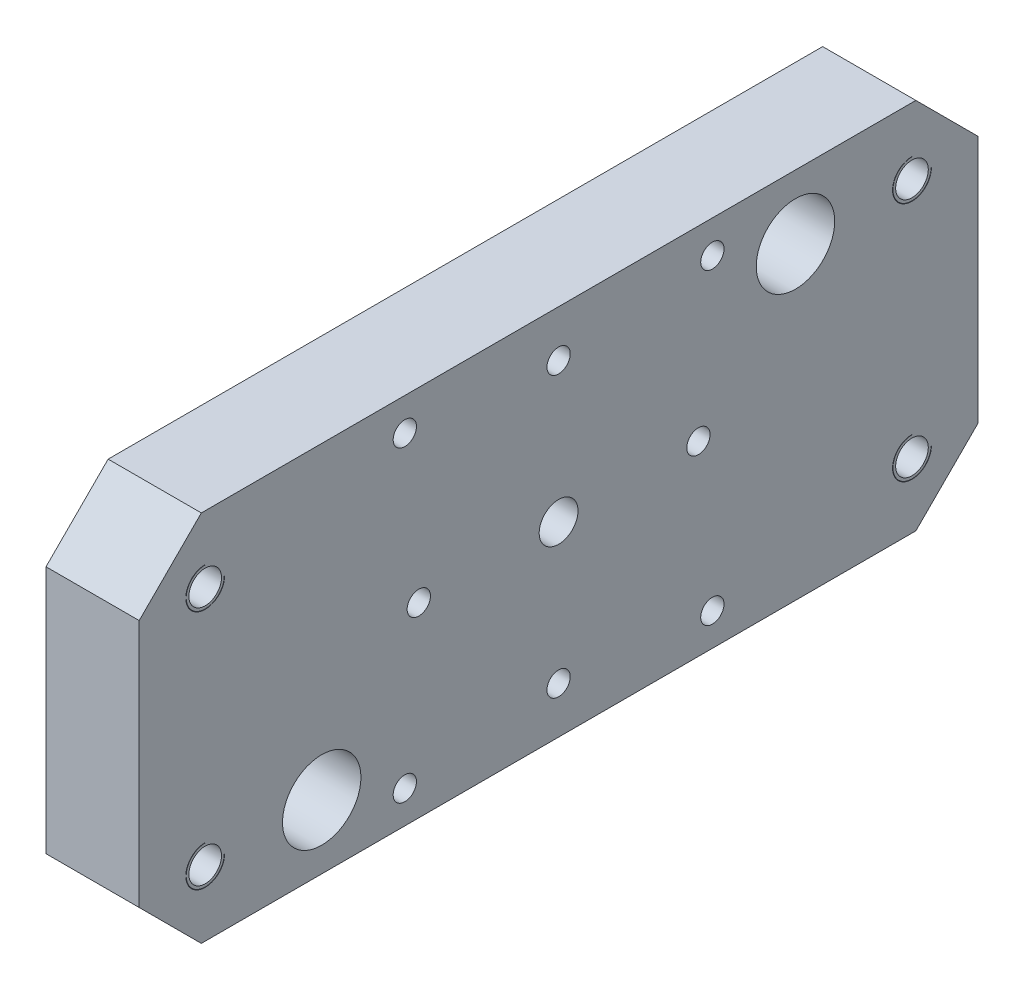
ISO-10303-21;
HEADER;
FILE_DESCRIPTION(('STEP AP214'),'2;1');
FILE_NAME('part.step','',(''),(''),'','','');
FILE_SCHEMA(('AUTOMOTIVE_DESIGN { 1 0 10303 214 1 1 1 1 }'));
ENDSEC;
DATA;
#1=APPLICATION_CONTEXT('core data for automotive mechanical design processes');
#2=APPLICATION_PROTOCOL_DEFINITION('international standard','automotive_design',2000,#1);
#3=PRODUCT_CONTEXT('',#1,'mechanical');
#4=PRODUCT('Part','Part','',(#3));
#5=PRODUCT_RELATED_PRODUCT_CATEGORY('part','',(#4));
#6=PRODUCT_DEFINITION_FORMATION('','',#4);
#7=PRODUCT_DEFINITION_CONTEXT('part definition',#1,'design');
#8=PRODUCT_DEFINITION('design','',#6,#7);
#9=PRODUCT_DEFINITION_SHAPE('','',#8);
#10=(LENGTH_UNIT() NAMED_UNIT(*) SI_UNIT(.MILLI.,.METRE.));
#11=(NAMED_UNIT(*) PLANE_ANGLE_UNIT() SI_UNIT($,.RADIAN.));
#12=(NAMED_UNIT(*) SI_UNIT($,.STERADIAN.) SOLID_ANGLE_UNIT());
#13=UNCERTAINTY_MEASURE_WITH_UNIT(LENGTH_MEASURE(1.E-05),#10,'distance_accuracy_value','');
#14=(GEOMETRIC_REPRESENTATION_CONTEXT(3) GLOBAL_UNCERTAINTY_ASSIGNED_CONTEXT((#13)) GLOBAL_UNIT_ASSIGNED_CONTEXT((#10,
#11,#12)) REPRESENTATION_CONTEXT('',''));
#15=CARTESIAN_POINT('',(0.,0.,0.));
#16=DIRECTION('',(0.,0.,1.));
#17=DIRECTION('',(1.,0.,0.));
#18=AXIS2_PLACEMENT_3D('',#15,#16,#17);
#19=CARTESIAN_POINT('',(-44.,19.7989898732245,-19.798989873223));
#20=DIRECTION('',(1.,0.,0.));
#21=DIRECTION('',(0.,0.,-1.));
#22=AXIS2_PLACEMENT_3D('',#19,#20,#21);
#23=CYLINDRICAL_SURFACE('',#22,1.5);
#24=CARTESIAN_POINT('',(-32.,19.7989898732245,-19.798989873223));
#25=DIRECTION('',(1.,0.,0.));
#26=DIRECTION('',(0.,0.,-1.));
#27=AXIS2_PLACEMENT_3D('',#24,#25,#26);
#28=CIRCLE('',#27,1.5);
#29=CARTESIAN_POINT('',(-32.,19.7989898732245,-21.298989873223));
#30=VERTEX_POINT('',#29);
#31=EDGE_CURVE('E395',#30,#30,#28,.T.);
#32=ORIENTED_EDGE('',*,*,#31,.T.);
#33=EDGE_LOOP('',(#32));
#34=FACE_BOUND('',#33,.T.);
#35=CARTESIAN_POINT('',(-41.,19.7989898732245,-19.798989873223));
#36=DIRECTION('',(-1.,0.,0.));
#37=DIRECTION('',(0.,0.,1.));
#38=AXIS2_PLACEMENT_3D('',#35,#36,#37);
#39=CIRCLE('',#38,1.5);
#40=CARTESIAN_POINT('',(-41.,19.7989898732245,-18.298989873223));
#41=VERTEX_POINT('',#40);
#42=EDGE_CURVE('E42',#41,#41,#39,.F.);
#43=ORIENTED_EDGE('',*,*,#42,.F.);
#44=EDGE_LOOP('',(#43));
#45=FACE_BOUND('',#44,.T.);
#46=ADVANCED_FACE('F38',(#34,#45),#23,.F.);
#47=CARTESIAN_POINT('',(-44.,18.,0.));
#48=DIRECTION('',(1.,0.,0.));
#49=DIRECTION('',(0.,0.,-1.));
#50=AXIS2_PLACEMENT_3D('',#47,#48,#49);
#51=CYLINDRICAL_SURFACE('',#50,1.5);
#52=CARTESIAN_POINT('',(-32.,18.,0.));
#53=DIRECTION('',(1.,0.,0.));
#54=DIRECTION('',(0.,0.,-1.));
#55=AXIS2_PLACEMENT_3D('',#52,#53,#54);
#56=CIRCLE('',#55,1.5);
#57=CARTESIAN_POINT('',(-32.,18.,-1.5));
#58=VERTEX_POINT('',#57);
#59=EDGE_CURVE('E368',#58,#58,#56,.T.);
#60=ORIENTED_EDGE('',*,*,#59,.T.);
#61=EDGE_LOOP('',(#60));
#62=FACE_BOUND('',#61,.T.);
#63=CARTESIAN_POINT('',(-41.,18.,0.));
#64=DIRECTION('',(-1.,0.,0.));
#65=DIRECTION('',(0.,0.,1.));
#66=AXIS2_PLACEMENT_3D('',#63,#64,#65);
#67=CIRCLE('',#66,1.5);
#68=CARTESIAN_POINT('',(-41.,18.,1.5));
#69=VERTEX_POINT('',#68);
#70=EDGE_CURVE('E302',#69,#69,#67,.F.);
#71=ORIENTED_EDGE('',*,*,#70,.F.);
#72=EDGE_LOOP('',(#71));
#73=FACE_BOUND('',#72,.T.);
#74=ADVANCED_FACE('F712',(#62,#73),#51,.F.);
#75=CARTESIAN_POINT('',(-44.,1.21529014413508E-12,-17.9999999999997));
#76=DIRECTION('',(1.,0.,0.));
#77=DIRECTION('',(0.,0.,-1.));
#78=AXIS2_PLACEMENT_3D('',#75,#76,#77);
#79=CYLINDRICAL_SURFACE('',#78,1.4999999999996);
#80=CARTESIAN_POINT('',(-32.,1.21529014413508E-12,-17.9999999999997));
#81=DIRECTION('',(1.,0.,0.));
#82=DIRECTION('',(0.,0.,-1.));
#83=AXIS2_PLACEMENT_3D('',#80,#81,#82);
#84=CIRCLE('',#83,1.4999999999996);
#85=CARTESIAN_POINT('',(-32.,1.21529014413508E-12,-19.4999999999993));
#86=VERTEX_POINT('',#85);
#87=EDGE_CURVE('E392',#86,#86,#84,.T.);
#88=ORIENTED_EDGE('',*,*,#87,.T.);
#89=EDGE_LOOP('',(#88));
#90=FACE_BOUND('',#89,.T.);
#91=CARTESIAN_POINT('',(-41.,1.21529014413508E-12,-17.9999999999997));
#92=DIRECTION('',(-1.,0.,0.));
#93=DIRECTION('',(0.,0.,1.));
#94=AXIS2_PLACEMENT_3D('',#91,#92,#93);
#95=CIRCLE('',#94,1.4999999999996);
#96=CARTESIAN_POINT('',(-41.,1.21529014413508E-12,-16.5000000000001));
#97=VERTEX_POINT('',#96);
#98=EDGE_CURVE('E297',#97,#97,#95,.F.);
#99=ORIENTED_EDGE('',*,*,#98,.F.);
#100=EDGE_LOOP('',(#99));
#101=FACE_BOUND('',#100,.T.);
#102=ADVANCED_FACE('F718',(#90,#101),#79,.F.);
#103=CARTESIAN_POINT('',(-44.,-19.798989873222,-19.7989898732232));
#104=DIRECTION('',(1.,0.,0.));
#105=DIRECTION('',(0.,0.,-1.));
#106=AXIS2_PLACEMENT_3D('',#103,#104,#105);
#107=CYLINDRICAL_SURFACE('',#106,1.5);
#108=CARTESIAN_POINT('',(-32.,-19.798989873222,-19.7989898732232));
#109=DIRECTION('',(1.,0.,0.));
#110=DIRECTION('',(0.,0.,-1.));
#111=AXIS2_PLACEMENT_3D('',#108,#109,#110);
#112=CIRCLE('',#111,1.5);
#113=CARTESIAN_POINT('',(-32.,-19.798989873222,-21.2989898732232));
#114=VERTEX_POINT('',#113);
#115=EDGE_CURVE('E388',#114,#114,#112,.T.);
#116=ORIENTED_EDGE('',*,*,#115,.T.);
#117=EDGE_LOOP('',(#116));
#118=FACE_BOUND('',#117,.T.);
#119=CARTESIAN_POINT('',(-41.,-19.798989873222,-19.7989898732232));
#120=DIRECTION('',(-1.,0.,0.));
#121=DIRECTION('',(0.,0.,1.));
#122=AXIS2_PLACEMENT_3D('',#119,#120,#121);
#123=CIRCLE('',#122,1.5);
#124=CARTESIAN_POINT('',(-41.,-19.798989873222,-18.2989898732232));
#125=VERTEX_POINT('',#124);
#126=EDGE_CURVE('E291',#125,#125,#123,.F.);
#127=ORIENTED_EDGE('',*,*,#126,.F.);
#128=EDGE_LOOP('',(#127));
#129=FACE_BOUND('',#128,.T.);
#130=ADVANCED_FACE('F1133',(#118,#129),#107,.F.);
#131=CARTESIAN_POINT('',(-44.,-17.9999999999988,2.47934110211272E-13));
#132=DIRECTION('',(1.,0.,0.));
#133=DIRECTION('',(0.,0.,-1.));
#134=AXIS2_PLACEMENT_3D('',#131,#132,#133);
#135=CYLINDRICAL_SURFACE('',#134,1.5000000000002);
#136=CARTESIAN_POINT('',(-32.,-17.9999999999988,2.47934110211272E-13));
#137=DIRECTION('',(1.,0.,0.));
#138=DIRECTION('',(0.,0.,-1.));
#139=AXIS2_PLACEMENT_3D('',#136,#137,#138);
#140=CIRCLE('',#139,1.5000000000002);
#141=CARTESIAN_POINT('',(-32.,-17.9999999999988,-1.49999999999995));
#142=VERTEX_POINT('',#141);
#143=EDGE_CURVE('E384',#142,#142,#140,.T.);
#144=ORIENTED_EDGE('',*,*,#143,.T.);
#145=EDGE_LOOP('',(#144));
#146=FACE_BOUND('',#145,.T.);
#147=CARTESIAN_POINT('',(-41.,-17.9999999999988,2.47934110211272E-13));
#148=DIRECTION('',(-1.,0.,0.));
#149=DIRECTION('',(0.,0.,1.));
#150=AXIS2_PLACEMENT_3D('',#147,#148,#149);
#151=CIRCLE('',#150,1.5000000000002);
#152=CARTESIAN_POINT('',(-41.,-17.9999999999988,1.50000000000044));
#153=VERTEX_POINT('',#152);
#154=EDGE_CURVE('E285',#153,#153,#151,.F.);
#155=ORIENTED_EDGE('',*,*,#154,.F.);
#156=EDGE_LOOP('',(#155));
#157=FACE_BOUND('',#156,.T.);
#158=ADVANCED_FACE('F1142',(#146,#157),#135,.F.);
#159=CARTESIAN_POINT('',(-44.,-19.7989898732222,19.7989898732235));
#160=DIRECTION('',(1.,0.,0.));
#161=DIRECTION('',(0.,0.,-1.));
#162=AXIS2_PLACEMENT_3D('',#159,#160,#161);
#163=CYLINDRICAL_SURFACE('',#162,1.50000000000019);
#164=CARTESIAN_POINT('',(-32.,-19.7989898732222,19.7989898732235));
#165=DIRECTION('',(1.,0.,0.));
#166=DIRECTION('',(0.,0.,-1.));
#167=AXIS2_PLACEMENT_3D('',#164,#165,#166);
#168=CIRCLE('',#167,1.50000000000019);
#169=CARTESIAN_POINT('',(-32.,-19.7989898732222,18.2989898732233));
#170=VERTEX_POINT('',#169);
#171=EDGE_CURVE('E380',#170,#170,#168,.T.);
#172=ORIENTED_EDGE('',*,*,#171,.T.);
#173=EDGE_LOOP('',(#172));
#174=FACE_BOUND('',#173,.T.);
#175=CARTESIAN_POINT('',(-41.,-19.7989898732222,19.7989898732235));
#176=DIRECTION('',(-1.,0.,0.));
#177=DIRECTION('',(0.,0.,1.));
#178=AXIS2_PLACEMENT_3D('',#175,#176,#177);
#179=CIRCLE('',#178,1.50000000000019);
#180=CARTESIAN_POINT('',(-41.,-19.7989898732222,21.2989898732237));
#181=VERTEX_POINT('',#180);
#182=EDGE_CURVE('E279',#181,#181,#179,.F.);
#183=ORIENTED_EDGE('',*,*,#182,.F.);
#184=EDGE_LOOP('',(#183));
#185=FACE_BOUND('',#184,.T.);
#186=ADVANCED_FACE('F1151',(#174,#185),#163,.F.);
#187=CARTESIAN_POINT('',(-44.,19.7989898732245,19.7989898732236));
#188=DIRECTION('',(1.,0.,0.));
#189=DIRECTION('',(0.,0.,-1.));
#190=AXIS2_PLACEMENT_3D('',#187,#188,#189);
#191=CYLINDRICAL_SURFACE('',#190,1.50000000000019);
#192=CARTESIAN_POINT('',(-32.,19.7989898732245,19.7989898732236));
#193=DIRECTION('',(1.,0.,0.));
#194=DIRECTION('',(0.,0.,-1.));
#195=AXIS2_PLACEMENT_3D('',#192,#193,#194);
#196=CIRCLE('',#195,1.50000000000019);
#197=CARTESIAN_POINT('',(-32.,19.7989898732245,18.2989898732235));
#198=VERTEX_POINT('',#197);
#199=EDGE_CURVE('E376',#198,#198,#196,.T.);
#200=ORIENTED_EDGE('',*,*,#199,.T.);
#201=EDGE_LOOP('',(#200));
#202=FACE_BOUND('',#201,.T.);
#203=CARTESIAN_POINT('',(-41.,19.7989898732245,19.7989898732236));
#204=DIRECTION('',(-1.,0.,0.));
#205=DIRECTION('',(0.,0.,1.));
#206=AXIS2_PLACEMENT_3D('',#203,#204,#205);
#207=CIRCLE('',#206,1.50000000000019);
#208=CARTESIAN_POINT('',(-41.,19.7989898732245,21.2989898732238));
#209=VERTEX_POINT('',#208);
#210=EDGE_CURVE('E273',#209,#209,#207,.F.);
#211=ORIENTED_EDGE('',*,*,#210,.F.);
#212=EDGE_LOOP('',(#211));
#213=FACE_BOUND('',#212,.T.);
#214=ADVANCED_FACE('F1161',(#202,#213),#191,.F.);
#215=CARTESIAN_POINT('',(-44.,1.14888081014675E-12,18.0000000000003));
#216=DIRECTION('',(1.,0.,0.));
#217=DIRECTION('',(0.,0.,-1.));
#218=AXIS2_PLACEMENT_3D('',#215,#216,#217);
#219=CYLINDRICAL_SURFACE('',#218,1.50000000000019);
#220=CARTESIAN_POINT('',(-32.,1.14888081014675E-12,18.0000000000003));
#221=DIRECTION('',(1.,0.,0.));
#222=DIRECTION('',(0.,0.,-1.));
#223=AXIS2_PLACEMENT_3D('',#220,#221,#222);
#224=CIRCLE('',#223,1.50000000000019);
#225=CARTESIAN_POINT('',(-32.,1.14888081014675E-12,16.5000000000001));
#226=VERTEX_POINT('',#225);
#227=EDGE_CURVE('E372',#226,#226,#224,.T.);
#228=ORIENTED_EDGE('',*,*,#227,.T.);
#229=EDGE_LOOP('',(#228));
#230=FACE_BOUND('',#229,.T.);
#231=CARTESIAN_POINT('',(-41.,1.14888081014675E-12,18.0000000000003));
#232=DIRECTION('',(-1.,0.,0.));
#233=DIRECTION('',(0.,0.,1.));
#234=AXIS2_PLACEMENT_3D('',#231,#232,#233);
#235=CIRCLE('',#234,1.50000000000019);
#236=CARTESIAN_POINT('',(-41.,1.14888081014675E-12,19.5000000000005));
#237=VERTEX_POINT('',#236);
#238=EDGE_CURVE('E267',#237,#237,#235,.F.);
#239=ORIENTED_EDGE('',*,*,#238,.F.);
#240=EDGE_LOOP('',(#239));
#241=FACE_BOUND('',#240,.T.);
#242=ADVANCED_FACE('F1171',(#230,#241),#219,.F.);
#243=CARTESIAN_POINT('',(-44.,0.,0.));
#244=DIRECTION('',(1.,0.,0.));
#245=DIRECTION('',(0.,0.,-1.));
#246=AXIS2_PLACEMENT_3D('',#243,#244,#245);
#247=CYLINDRICAL_SURFACE('',#246,2.5);
#248=CARTESIAN_POINT('',(-32.,0.,0.));
#249=DIRECTION('',(1.,0.,0.));
#250=DIRECTION('',(0.,0.,-1.));
#251=AXIS2_PLACEMENT_3D('',#248,#249,#250);
#252=CIRCLE('',#251,2.5);
#253=CARTESIAN_POINT('',(-32.,0.,-2.5));
#254=VERTEX_POINT('',#253);
#255=EDGE_CURVE('E265',#254,#254,#252,.T.);
#256=ORIENTED_EDGE('',*,*,#255,.T.);
#257=EDGE_LOOP('',(#256));
#258=FACE_BOUND('',#257,.T.);
#259=CARTESIAN_POINT('',(-41.,0.,0.));
#260=DIRECTION('',(-1.,0.,0.));
#261=DIRECTION('',(0.,0.,1.));
#262=AXIS2_PLACEMENT_3D('',#259,#260,#261);
#263=CIRCLE('',#262,2.5);
#264=CARTESIAN_POINT('',(-41.,0.,2.5));
#265=VERTEX_POINT('',#264);
#266=EDGE_CURVE('E261',#265,#265,#263,.F.);
#267=ORIENTED_EDGE('',*,*,#266,.F.);
#268=EDGE_LOOP('',(#267));
#269=FACE_BOUND('',#268,.T.);
#270=ADVANCED_FACE('F727',(#258,#269),#247,.F.);
#271=CARTESIAN_POINT('',(-32.,0.,0.));
#272=DIRECTION('',(1.,0.,0.));
#273=DIRECTION('',(0.,0.,-1.));
#274=AXIS2_PLACEMENT_3D('',#271,#272,#273);
#275=PLANE('',#274);
#276=ORIENTED_EDGE('',*,*,#255,.F.);
#277=EDGE_LOOP('',(#276));
#278=FACE_BOUND('',#277,.T.);
#279=ORIENTED_EDGE('',*,*,#59,.F.);
#280=EDGE_LOOP('',(#279));
#281=FACE_BOUND('',#280,.T.);
#282=ORIENTED_EDGE('',*,*,#227,.F.);
#283=EDGE_LOOP('',(#282));
#284=FACE_BOUND('',#283,.T.);
#285=ORIENTED_EDGE('',*,*,#199,.F.);
#286=EDGE_LOOP('',(#285));
#287=FACE_BOUND('',#286,.T.);
#288=ORIENTED_EDGE('',*,*,#171,.F.);
#289=EDGE_LOOP('',(#288));
#290=FACE_BOUND('',#289,.T.);
#291=ORIENTED_EDGE('',*,*,#143,.F.);
#292=EDGE_LOOP('',(#291));
#293=FACE_BOUND('',#292,.T.);
#294=ORIENTED_EDGE('',*,*,#115,.F.);
#295=EDGE_LOOP('',(#294));
#296=FACE_BOUND('',#295,.T.);
#297=ORIENTED_EDGE('',*,*,#87,.F.);
#298=EDGE_LOOP('',(#297));
#299=FACE_BOUND('',#298,.T.);
#300=ORIENTED_EDGE('',*,*,#31,.F.);
#301=EDGE_LOOP('',(#300));
#302=FACE_BOUND('',#301,.T.);
#303=DIRECTION('',(0.,0.707106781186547,0.707106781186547));
#304=VECTOR('',#303,1.);
#305=CARTESIAN_POINT('',(-32.,-24.,46.));
#306=LINE('',#305,#304);
#307=CARTESIAN_POINT('',(-32.,-24.,46.));
#308=VERTEX_POINT('',#307);
#309=CARTESIAN_POINT('',(-32.,-16.,54.));
#310=VERTEX_POINT('',#309);
#311=EDGE_CURVE('E602',#308,#310,#306,.T.);
#312=ORIENTED_EDGE('',*,*,#311,.F.);
#313=DIRECTION('',(0.,0.,1.));
#314=VECTOR('',#313,1.);
#315=CARTESIAN_POINT('',(-32.,-24.,-46.));
#316=LINE('',#315,#314);
#317=CARTESIAN_POINT('',(-32.,-24.,-46.));
#318=VERTEX_POINT('',#317);
#319=EDGE_CURVE('E217',#318,#308,#316,.T.);
#320=ORIENTED_EDGE('',*,*,#319,.F.);
#321=DIRECTION('',(0.,-0.707106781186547,0.707106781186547));
#322=VECTOR('',#321,1.);
#323=CARTESIAN_POINT('',(-32.,-16.,-54.));
#324=LINE('',#323,#322);
#325=CARTESIAN_POINT('',(-32.,-16.,-54.));
#326=VERTEX_POINT('',#325);
#327=EDGE_CURVE('E581',#326,#318,#324,.T.);
#328=ORIENTED_EDGE('',*,*,#327,.F.);
#329=DIRECTION('',(0.,-1.,0.));
#330=VECTOR('',#329,1.);
#331=CARTESIAN_POINT('',(-32.,16.,-54.));
#332=LINE('',#331,#330);
#333=CARTESIAN_POINT('',(-32.,16.,-54.));
#334=VERTEX_POINT('',#333);
#335=EDGE_CURVE('E473',#334,#326,#332,.T.);
#336=ORIENTED_EDGE('',*,*,#335,.F.);
#337=DIRECTION('',(0.,-0.707106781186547,-0.707106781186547));
#338=VECTOR('',#337,1.);
#339=CARTESIAN_POINT('',(-32.,24.,-46.));
#340=LINE('',#339,#338);
#341=CARTESIAN_POINT('',(-32.,24.,-46.));
#342=VERTEX_POINT('',#341);
#343=EDGE_CURVE('E437',#342,#334,#340,.T.);
#344=ORIENTED_EDGE('',*,*,#343,.F.);
#345=DIRECTION('',(0.,0.,-1.));
#346=VECTOR('',#345,1.);
#347=CARTESIAN_POINT('',(-32.,24.,46.));
#348=LINE('',#347,#346);
#349=CARTESIAN_POINT('',(-32.,24.,46.));
#350=VERTEX_POINT('',#349);
#351=EDGE_CURVE('E248',#350,#342,#348,.T.);
#352=ORIENTED_EDGE('',*,*,#351,.F.);
#353=DIRECTION('',(0.,0.707106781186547,-0.707106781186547));
#354=VECTOR('',#353,1.);
#355=CARTESIAN_POINT('',(-32.,16.,54.));
#356=LINE('',#355,#354);
#357=CARTESIAN_POINT('',(-32.,16.,54.));
#358=VERTEX_POINT('',#357);
#359=EDGE_CURVE('E223',#358,#350,#356,.T.);
#360=ORIENTED_EDGE('',*,*,#359,.F.);
#361=DIRECTION('',(0.,1.,0.));
#362=VECTOR('',#361,1.);
#363=CARTESIAN_POINT('',(-32.,-16.,54.));
#364=LINE('',#363,#362);
#365=EDGE_CURVE('E238',#310,#358,#364,.T.);
#366=ORIENTED_EDGE('',*,*,#365,.F.);
#367=EDGE_LOOP('',(#312,#320,#328,#336,#344,#352,#360,#366));
#368=FACE_BOUND('',#367,.T.);
#369=CARTESIAN_POINT('',(-32.,-15.75,30.5));
#370=DIRECTION('',(-1.,0.,0.));
#371=DIRECTION('',(0.,0.,-1.));
#372=AXIS2_PLACEMENT_3D('',#369,#370,#371);
#373=CIRCLE('',#372,5.05);
#374=CARTESIAN_POINT('',(-32.,-15.75,25.45));
#375=VERTEX_POINT('',#374);
#376=EDGE_CURVE('E11',#375,#375,#373,.T.);
#377=ORIENTED_EDGE('',*,*,#376,.T.);
#378=EDGE_LOOP('',(#377));
#379=FACE_BOUND('',#378,.T.);
#380=CARTESIAN_POINT('',(-32.,-15.5,45.5));
#381=DIRECTION('',(-1.,0.,0.));
#382=DIRECTION('',(0.,0.,-1.));
#383=AXIS2_PLACEMENT_3D('',#380,#381,#382);
#384=CIRCLE('',#383,2.1);
#385=CARTESIAN_POINT('',(-32.,-15.5,43.4));
#386=VERTEX_POINT('',#385);
#387=EDGE_CURVE('E49',#386,#386,#384,.T.);
#388=ORIENTED_EDGE('',*,*,#387,.T.);
#389=EDGE_LOOP('',(#388));
#390=FACE_BOUND('',#389,.T.);
#391=CARTESIAN_POINT('',(-32.,-15.5,45.5));
#392=DIRECTION('',(1.,0.,0.));
#393=DIRECTION('',(0.,1.,0.));
#394=AXIS2_PLACEMENT_3D('',#391,#392,#393);
#395=CIRCLE('',#394,2.45);
#396=CARTESIAN_POINT('',(-32.,-13.05,45.5));
#397=VERTEX_POINT('',#396);
#398=CARTESIAN_POINT('',(-32.,-15.5,43.05));
#399=VERTEX_POINT('',#398);
#400=EDGE_CURVE('E511',#397,#399,#395,.T.);
#401=ORIENTED_EDGE('',*,*,#400,.T.);
#402=DIRECTION('',(0.,0.,-1.));
#403=VECTOR('',#402,1.);
#404=CARTESIAN_POINT('',(-32.,-15.5,21.5125));
#405=LINE('',#404,#403);
#406=CARTESIAN_POINT('',(-32.,-15.5,43.));
#407=VERTEX_POINT('',#406);
#408=EDGE_CURVE('E435',#399,#407,#405,.T.);
#409=ORIENTED_EDGE('',*,*,#408,.T.);
#410=CARTESIAN_POINT('',(-32.,-15.5,45.5));
#411=DIRECTION('',(-1.,0.,0.));
#412=DIRECTION('',(0.,1.,0.));
#413=AXIS2_PLACEMENT_3D('',#410,#411,#412);
#414=CIRCLE('',#413,2.5);
#415=CARTESIAN_POINT('',(-32.,-13.,45.5));
#416=VERTEX_POINT('',#415);
#417=EDGE_CURVE('E431',#407,#416,#414,.T.);
#418=ORIENTED_EDGE('',*,*,#417,.T.);
#419=DIRECTION('',(0.,-1.,0.));
#420=VECTOR('',#419,1.);
#421=CARTESIAN_POINT('',(-32.,-6.5125,45.5));
#422=LINE('',#421,#420);
#423=EDGE_CURVE('E436',#416,#397,#422,.T.);
#424=ORIENTED_EDGE('',*,*,#423,.T.);
#425=EDGE_LOOP('',(#401,#409,#418,#424));
#426=FACE_BOUND('',#425,.T.);
#427=CARTESIAN_POINT('',(-32.,15.5,45.5));
#428=DIRECTION('',(-1.,0.,0.));
#429=DIRECTION('',(0.,0.,-1.));
#430=AXIS2_PLACEMENT_3D('',#427,#428,#429);
#431=CIRCLE('',#430,2.1);
#432=CARTESIAN_POINT('',(-32.,15.5,43.4));
#433=VERTEX_POINT('',#432);
#434=EDGE_CURVE('E445',#433,#433,#431,.T.);
#435=ORIENTED_EDGE('',*,*,#434,.T.);
#436=EDGE_LOOP('',(#435));
#437=FACE_BOUND('',#436,.T.);
#438=DIRECTION('',(0.,-1.,0.));
#439=VECTOR('',#438,1.);
#440=CARTESIAN_POINT('',(-32.,8.9875,45.5));
#441=LINE('',#440,#439);
#442=CARTESIAN_POINT('',(-32.,18.,45.5));
#443=VERTEX_POINT('',#442);
#444=CARTESIAN_POINT('',(-32.,17.95,45.5));
#445=VERTEX_POINT('',#444);
#446=EDGE_CURVE('E499',#443,#445,#441,.T.);
#447=ORIENTED_EDGE('',*,*,#446,.T.);
#448=CARTESIAN_POINT('',(-32.,15.5,45.5));
#449=DIRECTION('',(1.,0.,0.));
#450=DIRECTION('',(0.,1.,0.));
#451=AXIS2_PLACEMENT_3D('',#448,#449,#450);
#452=CIRCLE('',#451,2.45);
#453=CARTESIAN_POINT('',(-32.,15.5,43.05));
#454=VERTEX_POINT('',#453);
#455=EDGE_CURVE('E460',#445,#454,#452,.T.);
#456=ORIENTED_EDGE('',*,*,#455,.T.);
#457=DIRECTION('',(0.,0.,-1.));
#458=VECTOR('',#457,1.);
#459=CARTESIAN_POINT('',(-32.,15.5,21.5125));
#460=LINE('',#459,#458);
#461=CARTESIAN_POINT('',(-32.,15.5,43.));
#462=VERTEX_POINT('',#461);
#463=EDGE_CURVE('E464',#454,#462,#460,.T.);
#464=ORIENTED_EDGE('',*,*,#463,.T.);
#465=CARTESIAN_POINT('',(-32.,15.5,45.5));
#466=DIRECTION('',(-1.,0.,0.));
#467=DIRECTION('',(0.,1.,0.));
#468=AXIS2_PLACEMENT_3D('',#465,#466,#467);
#469=CIRCLE('',#468,2.5);
#470=EDGE_CURVE('E495',#462,#443,#469,.T.);
#471=ORIENTED_EDGE('',*,*,#470,.T.);
#472=EDGE_LOOP('',(#447,#456,#464,#471));
#473=FACE_BOUND('',#472,.T.);
#474=CARTESIAN_POINT('',(-32.,15.75,-30.5));
#475=DIRECTION('',(-1.,0.,0.));
#476=DIRECTION('',(0.,0.,-1.));
#477=AXIS2_PLACEMENT_3D('',#474,#475,#476);
#478=CIRCLE('',#477,5.05);
#479=CARTESIAN_POINT('',(-32.,15.75,-35.55));
#480=VERTEX_POINT('',#479);
#481=EDGE_CURVE('E565',#480,#480,#478,.T.);
#482=ORIENTED_EDGE('',*,*,#481,.T.);
#483=EDGE_LOOP('',(#482));
#484=FACE_BOUND('',#483,.T.);
#485=CARTESIAN_POINT('',(-32.,15.5,-45.5));
#486=DIRECTION('',(-1.,0.,0.));
#487=DIRECTION('',(0.,0.,-1.));
#488=AXIS2_PLACEMENT_3D('',#485,#486,#487);
#489=CIRCLE('',#488,2.1);
#490=CARTESIAN_POINT('',(-32.,15.5,-47.6));
#491=VERTEX_POINT('',#490);
#492=EDGE_CURVE('E507',#491,#491,#489,.T.);
#493=ORIENTED_EDGE('',*,*,#492,.T.);
#494=EDGE_LOOP('',(#493));
#495=FACE_BOUND('',#494,.T.);
#496=DIRECTION('',(0.,-1.,0.));
#497=VECTOR('',#496,1.);
#498=CARTESIAN_POINT('',(-32.,8.9875,-45.5));
#499=LINE('',#498,#497);
#500=CARTESIAN_POINT('',(-32.,18.,-45.5));
#501=VERTEX_POINT('',#500);
#502=CARTESIAN_POINT('',(-32.,17.95,-45.5));
#503=VERTEX_POINT('',#502);
#504=EDGE_CURVE('E182',#501,#503,#499,.T.);
#505=ORIENTED_EDGE('',*,*,#504,.T.);
#506=CARTESIAN_POINT('',(-32.,15.5,-45.5));
#507=DIRECTION('',(1.,0.,0.));
#508=DIRECTION('',(0.,1.,0.));
#509=AXIS2_PLACEMENT_3D('',#506,#507,#508);
#510=CIRCLE('',#509,2.45);
#511=CARTESIAN_POINT('',(-32.,15.5,-47.95));
#512=VERTEX_POINT('',#511);
#513=EDGE_CURVE('E504',#503,#512,#510,.T.);
#514=ORIENTED_EDGE('',*,*,#513,.T.);
#515=DIRECTION('',(0.,0.,-1.));
#516=VECTOR('',#515,1.);
#517=CARTESIAN_POINT('',(-32.,15.5,-23.9875));
#518=LINE('',#517,#516);
#519=CARTESIAN_POINT('',(-32.,15.5,-48.));
#520=VERTEX_POINT('',#519);
#521=EDGE_CURVE('E197',#512,#520,#518,.T.);
#522=ORIENTED_EDGE('',*,*,#521,.T.);
#523=CARTESIAN_POINT('',(-32.,15.5,-45.5));
#524=DIRECTION('',(-1.,0.,0.));
#525=DIRECTION('',(0.,1.,0.));
#526=AXIS2_PLACEMENT_3D('',#523,#524,#525);
#527=CIRCLE('',#526,2.5);
#528=EDGE_CURVE('E175',#520,#501,#527,.T.);
#529=ORIENTED_EDGE('',*,*,#528,.T.);
#530=EDGE_LOOP('',(#505,#514,#522,#529));
#531=FACE_BOUND('',#530,.T.);
#532=CARTESIAN_POINT('',(-32.,-15.5,-45.5));
#533=DIRECTION('',(-1.,0.,0.));
#534=DIRECTION('',(0.,0.,-1.));
#535=AXIS2_PLACEMENT_3D('',#532,#533,#534);
#536=CIRCLE('',#535,2.1);
#537=CARTESIAN_POINT('',(-32.,-15.5,-47.6));
#538=VERTEX_POINT('',#537);
#539=EDGE_CURVE('E191',#538,#538,#536,.T.);
#540=ORIENTED_EDGE('',*,*,#539,.T.);
#541=EDGE_LOOP('',(#540));
#542=FACE_BOUND('',#541,.T.);
#543=CARTESIAN_POINT('',(-32.,-15.5,-45.5));
#544=DIRECTION('',(1.,0.,0.));
#545=DIRECTION('',(0.,1.,0.));
#546=AXIS2_PLACEMENT_3D('',#543,#544,#545);
#547=CIRCLE('',#546,2.45);
#548=CARTESIAN_POINT('',(-32.,-13.05,-45.5));
#549=VERTEX_POINT('',#548);
#550=CARTESIAN_POINT('',(-32.,-15.5,-47.95));
#551=VERTEX_POINT('',#550);
#552=EDGE_CURVE('E456',#549,#551,#547,.T.);
#553=ORIENTED_EDGE('',*,*,#552,.T.);
#554=DIRECTION('',(0.,0.,-1.));
#555=VECTOR('',#554,1.);
#556=CARTESIAN_POINT('',(-32.,-15.5,-23.9875));
#557=LINE('',#556,#555);
#558=CARTESIAN_POINT('',(-32.,-15.5,-48.));
#559=VERTEX_POINT('',#558);
#560=EDGE_CURVE('E459',#551,#559,#557,.T.);
#561=ORIENTED_EDGE('',*,*,#560,.T.);
#562=CARTESIAN_POINT('',(-32.,-15.5,-45.5));
#563=DIRECTION('',(-1.,0.,0.));
#564=DIRECTION('',(0.,1.,0.));
#565=AXIS2_PLACEMENT_3D('',#562,#563,#564);
#566=CIRCLE('',#565,2.5);
#567=CARTESIAN_POINT('',(-32.,-13.,-45.5));
#568=VERTEX_POINT('',#567);
#569=EDGE_CURVE('E534',#559,#568,#566,.T.);
#570=ORIENTED_EDGE('',*,*,#569,.T.);
#571=DIRECTION('',(0.,-1.,0.));
#572=VECTOR('',#571,1.);
#573=CARTESIAN_POINT('',(-32.,-6.5125,-45.5));
#574=LINE('',#573,#572);
#575=EDGE_CURVE('E527',#568,#549,#574,.T.);
#576=ORIENTED_EDGE('',*,*,#575,.T.);
#577=EDGE_LOOP('',(#553,#561,#570,#576));
#578=FACE_BOUND('',#577,.T.);
#579=ADVANCED_FACE('F194',(#278,#281,#284,#287,#290,#293,#296,#299,#302,#368,#379,#390,#426,
#437,#473,#484,#495,#531,#542,#578),#275,.T.);
#580=CARTESIAN_POINT('',(-44.,0.,0.));
#581=DIRECTION('',(-1.,0.,0.));
#582=DIRECTION('',(0.,0.,1.));
#583=AXIS2_PLACEMENT_3D('',#580,#581,#582);
#584=PLANE('',#583);
#585=CARTESIAN_POINT('',(-44.,19.7989898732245,-19.798989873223));
#586=DIRECTION('',(-1.,0.,0.));
#587=DIRECTION('',(0.,0.,1.));
#588=AXIS2_PLACEMENT_3D('',#585,#586,#587);
#589=CIRCLE('',#588,3.25);
#590=CARTESIAN_POINT('',(-44.,19.7989898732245,-16.548989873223));
#591=VERTEX_POINT('',#590);
#592=EDGE_CURVE('E323',#591,#591,#589,.T.);
#593=ORIENTED_EDGE('',*,*,#592,.F.);
#594=EDGE_LOOP('',(#593));
#595=FACE_BOUND('',#594,.T.);
#596=CARTESIAN_POINT('',(-44.,18.,0.));
#597=DIRECTION('',(-1.,0.,0.));
#598=DIRECTION('',(0.,0.,1.));
#599=AXIS2_PLACEMENT_3D('',#596,#597,#598);
#600=CIRCLE('',#599,3.25);
#601=CARTESIAN_POINT('',(-44.,18.,3.25));
#602=VERTEX_POINT('',#601);
#603=EDGE_CURVE('E313',#602,#602,#600,.T.);
#604=ORIENTED_EDGE('',*,*,#603,.F.);
#605=EDGE_LOOP('',(#604));
#606=FACE_BOUND('',#605,.T.);
#607=CARTESIAN_POINT('',(-44.,1.21529014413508E-12,-17.9999999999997));
#608=DIRECTION('',(-1.,0.,0.));
#609=DIRECTION('',(0.,0.,1.));
#610=AXIS2_PLACEMENT_3D('',#607,#608,#609);
#611=CIRCLE('',#610,3.25);
#612=CARTESIAN_POINT('',(-44.,1.21529014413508E-12,-14.7499999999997));
#613=VERTEX_POINT('',#612);
#614=EDGE_CURVE('E304',#613,#613,#611,.T.);
#615=ORIENTED_EDGE('',*,*,#614,.F.);
#616=EDGE_LOOP('',(#615));
#617=FACE_BOUND('',#616,.T.);
#618=CARTESIAN_POINT('',(-44.,-19.798989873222,-19.7989898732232));
#619=DIRECTION('',(-1.,0.,0.));
#620=DIRECTION('',(0.,0.,1.));
#621=AXIS2_PLACEMENT_3D('',#618,#619,#620);
#622=CIRCLE('',#621,3.25);
#623=CARTESIAN_POINT('',(-44.,-19.798989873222,-16.5489898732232));
#624=VERTEX_POINT('',#623);
#625=EDGE_CURVE('E300',#624,#624,#622,.T.);
#626=ORIENTED_EDGE('',*,*,#625,.F.);
#627=EDGE_LOOP('',(#626));
#628=FACE_BOUND('',#627,.T.);
#629=CARTESIAN_POINT('',(-44.,-17.9999999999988,2.47934110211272E-13));
#630=DIRECTION('',(-1.,0.,0.));
#631=DIRECTION('',(0.,0.,1.));
#632=AXIS2_PLACEMENT_3D('',#629,#630,#631);
#633=CIRCLE('',#632,3.25);
#634=CARTESIAN_POINT('',(-44.,-17.9999999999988,3.25000000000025));
#635=VERTEX_POINT('',#634);
#636=EDGE_CURVE('E295',#635,#635,#633,.T.);
#637=ORIENTED_EDGE('',*,*,#636,.F.);
#638=EDGE_LOOP('',(#637));
#639=FACE_BOUND('',#638,.T.);
#640=CARTESIAN_POINT('',(-44.,-19.7989898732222,19.7989898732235));
#641=DIRECTION('',(-1.,0.,0.));
#642=DIRECTION('',(0.,0.,1.));
#643=AXIS2_PLACEMENT_3D('',#640,#641,#642);
#644=CIRCLE('',#643,3.25);
#645=CARTESIAN_POINT('',(-44.,-19.7989898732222,23.0489898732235));
#646=VERTEX_POINT('',#645);
#647=EDGE_CURVE('E289',#646,#646,#644,.T.);
#648=ORIENTED_EDGE('',*,*,#647,.F.);
#649=EDGE_LOOP('',(#648));
#650=FACE_BOUND('',#649,.T.);
#651=CARTESIAN_POINT('',(-44.,19.7989898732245,19.7989898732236));
#652=DIRECTION('',(-1.,0.,0.));
#653=DIRECTION('',(0.,0.,1.));
#654=AXIS2_PLACEMENT_3D('',#651,#652,#653);
#655=CIRCLE('',#654,3.25);
#656=CARTESIAN_POINT('',(-44.,19.7989898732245,23.0489898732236));
#657=VERTEX_POINT('',#656);
#658=EDGE_CURVE('E283',#657,#657,#655,.T.);
#659=ORIENTED_EDGE('',*,*,#658,.F.);
#660=EDGE_LOOP('',(#659));
#661=FACE_BOUND('',#660,.T.);
#662=CARTESIAN_POINT('',(-44.,1.14888081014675E-12,18.0000000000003));
#663=DIRECTION('',(-1.,0.,0.));
#664=DIRECTION('',(0.,0.,1.));
#665=AXIS2_PLACEMENT_3D('',#662,#663,#664);
#666=CIRCLE('',#665,3.25);
#667=CARTESIAN_POINT('',(-44.,1.14888081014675E-12,21.2500000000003));
#668=VERTEX_POINT('',#667);
#669=EDGE_CURVE('E277',#668,#668,#666,.T.);
#670=ORIENTED_EDGE('',*,*,#669,.F.);
#671=EDGE_LOOP('',(#670));
#672=FACE_BOUND('',#671,.T.);
#673=CARTESIAN_POINT('',(-44.,0.,0.));
#674=DIRECTION('',(-1.,0.,0.));
#675=DIRECTION('',(0.,0.,1.));
#676=AXIS2_PLACEMENT_3D('',#673,#674,#675);
#677=CIRCLE('',#676,5.25);
#678=CARTESIAN_POINT('',(-44.,0.,5.25));
#679=VERTEX_POINT('',#678);
#680=EDGE_CURVE('E271',#679,#679,#677,.T.);
#681=ORIENTED_EDGE('',*,*,#680,.F.);
#682=EDGE_LOOP('',(#681));
#683=FACE_BOUND('',#682,.T.);
#684=DIRECTION('',(0.,0.,1.));
#685=VECTOR('',#684,1.);
#686=CARTESIAN_POINT('',(-44.,-24.,-46.));
#687=LINE('',#686,#685);
#688=CARTESIAN_POINT('',(-44.,-24.,-46.));
#689=VERTEX_POINT('',#688);
#690=CARTESIAN_POINT('',(-44.,-24.,46.));
#691=VERTEX_POINT('',#690);
#692=EDGE_CURVE('E260',#689,#691,#687,.T.);
#693=ORIENTED_EDGE('',*,*,#692,.T.);
#694=DIRECTION('',(0.,0.707106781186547,0.707106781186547));
#695=VECTOR('',#694,1.);
#696=CARTESIAN_POINT('',(-44.,-24.,46.));
#697=LINE('',#696,#695);
#698=CARTESIAN_POINT('',(-44.,-16.,54.));
#699=VERTEX_POINT('',#698);
#700=EDGE_CURVE('E233',#691,#699,#697,.T.);
#701=ORIENTED_EDGE('',*,*,#700,.T.);
#702=DIRECTION('',(0.,1.,0.));
#703=VECTOR('',#702,1.);
#704=CARTESIAN_POINT('',(-44.,-16.,54.));
#705=LINE('',#704,#703);
#706=CARTESIAN_POINT('',(-44.,16.,54.));
#707=VERTEX_POINT('',#706);
#708=EDGE_CURVE('E229',#699,#707,#705,.T.);
#709=ORIENTED_EDGE('',*,*,#708,.T.);
#710=DIRECTION('',(0.,0.707106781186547,-0.707106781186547));
#711=VECTOR('',#710,1.);
#712=CARTESIAN_POINT('',(-44.,16.,54.));
#713=LINE('',#712,#711);
#714=CARTESIAN_POINT('',(-44.,24.,46.));
#715=VERTEX_POINT('',#714);
#716=EDGE_CURVE('E234',#707,#715,#713,.T.);
#717=ORIENTED_EDGE('',*,*,#716,.T.);
#718=DIRECTION('',(0.,0.,-1.));
#719=VECTOR('',#718,1.);
#720=CARTESIAN_POINT('',(-44.,24.,46.));
#721=LINE('',#720,#719);
#722=CARTESIAN_POINT('',(-44.,24.,-46.));
#723=VERTEX_POINT('',#722);
#724=EDGE_CURVE('E404',#715,#723,#721,.T.);
#725=ORIENTED_EDGE('',*,*,#724,.T.);
#726=DIRECTION('',(0.,-0.707106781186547,-0.707106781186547));
#727=VECTOR('',#726,1.);
#728=CARTESIAN_POINT('',(-44.,24.,-46.));
#729=LINE('',#728,#727);
#730=CARTESIAN_POINT('',(-44.,16.,-54.));
#731=VERTEX_POINT('',#730);
#732=EDGE_CURVE('E400',#723,#731,#729,.T.);
#733=ORIENTED_EDGE('',*,*,#732,.T.);
#734=DIRECTION('',(0.,-1.,0.));
#735=VECTOR('',#734,1.);
#736=CARTESIAN_POINT('',(-44.,16.,-54.));
#737=LINE('',#736,#735);
#738=CARTESIAN_POINT('',(-44.,-16.,-54.));
#739=VERTEX_POINT('',#738);
#740=EDGE_CURVE('E405',#731,#739,#737,.T.);
#741=ORIENTED_EDGE('',*,*,#740,.T.);
#742=DIRECTION('',(0.,-0.707106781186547,0.707106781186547));
#743=VECTOR('',#742,1.);
#744=CARTESIAN_POINT('',(-44.,-16.,-54.));
#745=LINE('',#744,#743);
#746=EDGE_CURVE('E469',#739,#689,#745,.T.);
#747=ORIENTED_EDGE('',*,*,#746,.T.);
#748=EDGE_LOOP('',(#693,#701,#709,#717,#725,#733,#741,#747));
#749=FACE_BOUND('',#748,.T.);
#750=CARTESIAN_POINT('',(-44.,-15.75,30.5));
#751=DIRECTION('',(1.,0.,0.));
#752=DIRECTION('',(0.,0.,-1.));
#753=AXIS2_PLACEMENT_3D('',#750,#751,#752);
#754=CIRCLE('',#753,5.05);
#755=CARTESIAN_POINT('',(-44.,-15.75,25.45));
#756=VERTEX_POINT('',#755);
#757=EDGE_CURVE('E465',#756,#756,#754,.T.);
#758=ORIENTED_EDGE('',*,*,#757,.T.);
#759=EDGE_LOOP('',(#758));
#760=FACE_BOUND('',#759,.T.);
#761=CARTESIAN_POINT('',(-44.,-15.5,45.5));
#762=DIRECTION('',(1.,0.,0.));
#763=DIRECTION('',(0.,0.,-1.));
#764=AXIS2_PLACEMENT_3D('',#761,#762,#763);
#765=CIRCLE('',#764,2.1);
#766=CARTESIAN_POINT('',(-44.,-15.5,43.4));
#767=VERTEX_POINT('',#766);
#768=EDGE_CURVE('E411',#767,#767,#765,.T.);
#769=ORIENTED_EDGE('',*,*,#768,.T.);
#770=EDGE_LOOP('',(#769));
#771=FACE_BOUND('',#770,.T.);
#772=DIRECTION('',(0.,0.,1.));
#773=VECTOR('',#772,1.);
#774=CARTESIAN_POINT('',(-44.,-15.5,21.5125));
#775=LINE('',#774,#773);
#776=CARTESIAN_POINT('',(-44.,-15.5,43.));
#777=VERTEX_POINT('',#776);
#778=CARTESIAN_POINT('',(-44.,-15.5,43.05));
#779=VERTEX_POINT('',#778);
#780=EDGE_CURVE('E476',#777,#779,#775,.T.);
#781=ORIENTED_EDGE('',*,*,#780,.T.);
#782=CARTESIAN_POINT('',(-44.,-15.5,45.5));
#783=DIRECTION('',(-1.,0.,0.));
#784=DIRECTION('',(0.,1.,0.));
#785=AXIS2_PLACEMENT_3D('',#782,#783,#784);
#786=CIRCLE('',#785,2.45);
#787=CARTESIAN_POINT('',(-44.,-13.05,45.5));
#788=VERTEX_POINT('',#787);
#789=EDGE_CURVE('E243',#779,#788,#786,.T.);
#790=ORIENTED_EDGE('',*,*,#789,.T.);
#791=DIRECTION('',(0.,1.,0.));
#792=VECTOR('',#791,1.);
#793=CARTESIAN_POINT('',(-44.,-6.5125,45.5));
#794=LINE('',#793,#792);
#795=CARTESIAN_POINT('',(-44.,-13.,45.5));
#796=VERTEX_POINT('',#795);
#797=EDGE_CURVE('E239',#788,#796,#794,.T.);
#798=ORIENTED_EDGE('',*,*,#797,.T.);
#799=CARTESIAN_POINT('',(-44.,-15.5,45.5));
#800=DIRECTION('',(1.,0.,0.));
#801=DIRECTION('',(0.,1.,0.));
#802=AXIS2_PLACEMENT_3D('',#799,#800,#801);
#803=CIRCLE('',#802,2.5);
#804=EDGE_CURVE('E163',#796,#777,#803,.T.);
#805=ORIENTED_EDGE('',*,*,#804,.T.);
#806=EDGE_LOOP('',(#781,#790,#798,#805));
#807=FACE_BOUND('',#806,.T.);
#808=CARTESIAN_POINT('',(-44.,15.5,45.5));
#809=DIRECTION('',(1.,0.,0.));
#810=DIRECTION('',(0.,0.,-1.));
#811=AXIS2_PLACEMENT_3D('',#808,#809,#810);
#812=CIRCLE('',#811,2.1);
#813=CARTESIAN_POINT('',(-44.,15.5,43.4));
#814=VERTEX_POINT('',#813);
#815=EDGE_CURVE('E450',#814,#814,#812,.T.);
#816=ORIENTED_EDGE('',*,*,#815,.T.);
#817=EDGE_LOOP('',(#816));
#818=FACE_BOUND('',#817,.T.);
#819=DIRECTION('',(0.,0.,1.));
#820=VECTOR('',#819,1.);
#821=CARTESIAN_POINT('',(-44.,15.5,21.5125));
#822=LINE('',#821,#820);
#823=CARTESIAN_POINT('',(-44.,15.5,43.));
#824=VERTEX_POINT('',#823);
#825=CARTESIAN_POINT('',(-44.,15.5,43.05));
#826=VERTEX_POINT('',#825);
#827=EDGE_CURVE('E477',#824,#826,#822,.T.);
#828=ORIENTED_EDGE('',*,*,#827,.T.);
#829=CARTESIAN_POINT('',(-44.,15.5,45.5));
#830=DIRECTION('',(-1.,0.,0.));
#831=DIRECTION('',(0.,1.,0.));
#832=AXIS2_PLACEMENT_3D('',#829,#830,#831);
#833=CIRCLE('',#832,2.45);
#834=CARTESIAN_POINT('',(-44.,17.95,45.5));
#835=VERTEX_POINT('',#834);
#836=EDGE_CURVE('E446',#826,#835,#833,.T.);
#837=ORIENTED_EDGE('',*,*,#836,.T.);
#838=DIRECTION('',(0.,1.,0.));
#839=VECTOR('',#838,1.);
#840=CARTESIAN_POINT('',(-44.,8.9875,45.5));
#841=LINE('',#840,#839);
#842=CARTESIAN_POINT('',(-44.,18.,45.5));
#843=VERTEX_POINT('',#842);
#844=EDGE_CURVE('E451',#835,#843,#841,.T.);
#845=ORIENTED_EDGE('',*,*,#844,.T.);
#846=CARTESIAN_POINT('',(-44.,15.5,45.5));
#847=DIRECTION('',(1.,0.,0.));
#848=DIRECTION('',(0.,1.,0.));
#849=AXIS2_PLACEMENT_3D('',#846,#847,#848);
#850=CIRCLE('',#849,2.5);
#851=EDGE_CURVE('E481',#843,#824,#850,.T.);
#852=ORIENTED_EDGE('',*,*,#851,.T.);
#853=EDGE_LOOP('',(#828,#837,#845,#852));
#854=FACE_BOUND('',#853,.T.);
#855=CARTESIAN_POINT('',(-44.,15.75,-30.5));
#856=DIRECTION('',(1.,0.,0.));
#857=DIRECTION('',(0.,0.,-1.));
#858=AXIS2_PLACEMENT_3D('',#855,#856,#857);
#859=CIRCLE('',#858,5.05);
#860=CARTESIAN_POINT('',(-44.,15.75,-35.55));
#861=VERTEX_POINT('',#860);
#862=EDGE_CURVE('E482',#861,#861,#859,.T.);
#863=ORIENTED_EDGE('',*,*,#862,.T.);
#864=EDGE_LOOP('',(#863));
#865=FACE_BOUND('',#864,.T.);
#866=CARTESIAN_POINT('',(-44.,15.5,-45.5));
#867=DIRECTION('',(1.,0.,0.));
#868=DIRECTION('',(0.,0.,-1.));
#869=AXIS2_PLACEMENT_3D('',#866,#867,#868);
#870=CIRCLE('',#869,2.1);
#871=CARTESIAN_POINT('',(-44.,15.5,-47.6));
#872=VERTEX_POINT('',#871);
#873=EDGE_CURVE('E494',#872,#872,#870,.T.);
#874=ORIENTED_EDGE('',*,*,#873,.T.);
#875=EDGE_LOOP('',(#874));
#876=FACE_BOUND('',#875,.T.);
#877=CARTESIAN_POINT('',(-44.,15.5,-45.5));
#878=DIRECTION('',(-1.,0.,0.));
#879=DIRECTION('',(0.,1.,0.));
#880=AXIS2_PLACEMENT_3D('',#877,#878,#879);
#881=CIRCLE('',#880,2.45);
#882=CARTESIAN_POINT('',(-44.,15.5,-47.95));
#883=VERTEX_POINT('',#882);
#884=CARTESIAN_POINT('',(-44.,17.95,-45.5));
#885=VERTEX_POINT('',#884);
#886=EDGE_CURVE('E455',#883,#885,#881,.T.);
#887=ORIENTED_EDGE('',*,*,#886,.T.);
#888=DIRECTION('',(0.,1.,0.));
#889=VECTOR('',#888,1.);
#890=CARTESIAN_POINT('',(-44.,8.9875,-45.5));
#891=LINE('',#890,#889);
#892=CARTESIAN_POINT('',(-44.,18.,-45.5));
#893=VERTEX_POINT('',#892);
#894=EDGE_CURVE('E452',#885,#893,#891,.T.);
#895=ORIENTED_EDGE('',*,*,#894,.T.);
#896=CARTESIAN_POINT('',(-44.,15.5,-45.5));
#897=DIRECTION('',(1.,0.,0.));
#898=DIRECTION('',(0.,1.,0.));
#899=AXIS2_PLACEMENT_3D('',#896,#897,#898);
#900=CIRCLE('',#899,2.5);
#901=CARTESIAN_POINT('',(-44.,15.5,-48.));
#902=VERTEX_POINT('',#901);
#903=EDGE_CURVE('E201',#893,#902,#900,.T.);
#904=ORIENTED_EDGE('',*,*,#903,.T.);
#905=DIRECTION('',(0.,0.,1.));
#906=VECTOR('',#905,1.);
#907=CARTESIAN_POINT('',(-44.,15.5,-23.9875));
#908=LINE('',#907,#906);
#909=EDGE_CURVE('E428',#902,#883,#908,.T.);
#910=ORIENTED_EDGE('',*,*,#909,.T.);
#911=EDGE_LOOP('',(#887,#895,#904,#910));
#912=FACE_BOUND('',#911,.T.);
#913=CARTESIAN_POINT('',(-44.,-15.5,-45.5));
#914=DIRECTION('',(1.,0.,0.));
#915=DIRECTION('',(0.,0.,-1.));
#916=AXIS2_PLACEMENT_3D('',#913,#914,#915);
#917=CIRCLE('',#916,2.1);
#918=CARTESIAN_POINT('',(-44.,-15.5,-47.6));
#919=VERTEX_POINT('',#918);
#920=EDGE_CURVE('E425',#919,#919,#917,.T.);
#921=ORIENTED_EDGE('',*,*,#920,.T.);
#922=EDGE_LOOP('',(#921));
#923=FACE_BOUND('',#922,.T.);
#924=CARTESIAN_POINT('',(-44.,-15.5,-45.5));
#925=DIRECTION('',(-1.,0.,0.));
#926=DIRECTION('',(0.,1.,0.));
#927=AXIS2_PLACEMENT_3D('',#924,#925,#926);
#928=CIRCLE('',#927,2.45);
#929=CARTESIAN_POINT('',(-44.,-15.5,-47.95));
#930=VERTEX_POINT('',#929);
#931=CARTESIAN_POINT('',(-44.,-13.05,-45.5));
#932=VERTEX_POINT('',#931);
#933=EDGE_CURVE('E429',#930,#932,#928,.T.);
#934=ORIENTED_EDGE('',*,*,#933,.T.);
#935=DIRECTION('',(0.,1.,0.));
#936=VECTOR('',#935,1.);
#937=CARTESIAN_POINT('',(-44.,-6.5125,-45.5));
#938=LINE('',#937,#936);
#939=CARTESIAN_POINT('',(-44.,-13.,-45.5));
#940=VERTEX_POINT('',#939);
#941=EDGE_CURVE('E424',#932,#940,#938,.T.);
#942=ORIENTED_EDGE('',*,*,#941,.T.);
#943=CARTESIAN_POINT('',(-44.,-15.5,-45.5));
#944=DIRECTION('',(1.,0.,0.));
#945=DIRECTION('',(0.,1.,0.));
#946=AXIS2_PLACEMENT_3D('',#943,#944,#945);
#947=CIRCLE('',#946,2.5);
#948=CARTESIAN_POINT('',(-44.,-15.5,-48.));
#949=VERTEX_POINT('',#948);
#950=EDGE_CURVE('E421',#940,#949,#947,.T.);
#951=ORIENTED_EDGE('',*,*,#950,.T.);
#952=DIRECTION('',(0.,0.,1.));
#953=VECTOR('',#952,1.);
#954=CARTESIAN_POINT('',(-44.,-15.5,-23.9875));
#955=LINE('',#954,#953);
#956=EDGE_CURVE('E221',#949,#930,#955,.T.);
#957=ORIENTED_EDGE('',*,*,#956,.T.);
#958=EDGE_LOOP('',(#934,#942,#951,#957));
#959=FACE_BOUND('',#958,.T.);
#960=ADVANCED_FACE('F661',(#595,#606,#617,#628,#639,#650,#661,#672,#683,#749,#760,#771,#807,
#818,#854,#865,#876,#912,#923,#959),#584,.T.);
#961=CARTESIAN_POINT('',(-44.,-24.,-46.));
#962=DIRECTION('',(0.,-1.,0.));
#963=DIRECTION('',(0.,0.,-1.));
#964=AXIS2_PLACEMENT_3D('',#961,#962,#963);
#965=PLANE('',#964);
#966=ORIENTED_EDGE('',*,*,#319,.T.);
#967=DIRECTION('',(1.,0.,0.));
#968=VECTOR('',#967,1.);
#969=CARTESIAN_POINT('',(-44.,-24.,46.));
#970=LINE('',#969,#968);
#971=EDGE_CURVE('E58',#691,#308,#970,.T.);
#972=ORIENTED_EDGE('',*,*,#971,.F.);
#973=ORIENTED_EDGE('',*,*,#692,.F.);
#974=DIRECTION('',(1.,0.,0.));
#975=VECTOR('',#974,1.);
#976=CARTESIAN_POINT('',(-44.,-24.,-46.));
#977=LINE('',#976,#975);
#978=EDGE_CURVE('E222',#689,#318,#977,.T.);
#979=ORIENTED_EDGE('',*,*,#978,.T.);
#980=EDGE_LOOP('',(#966,#972,#973,#979));
#981=FACE_BOUND('',#980,.T.);
#982=ADVANCED_FACE('F668',(#981),#965,.T.);
#983=CARTESIAN_POINT('',(-44.,-16.,-54.));
#984=DIRECTION('',(0.,-0.707106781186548,-0.707106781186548));
#985=DIRECTION('',(0.,0.707106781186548,-0.707106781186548));
#986=AXIS2_PLACEMENT_3D('',#983,#984,#985);
#987=PLANE('',#986);
#988=ORIENTED_EDGE('',*,*,#327,.T.);
#989=ORIENTED_EDGE('',*,*,#978,.F.);
#990=ORIENTED_EDGE('',*,*,#746,.F.);
#991=DIRECTION('',(1.,0.,0.));
#992=VECTOR('',#991,1.);
#993=CARTESIAN_POINT('',(-44.,-16.,-54.));
#994=LINE('',#993,#992);
#995=EDGE_CURVE('E577',#739,#326,#994,.T.);
#996=ORIENTED_EDGE('',*,*,#995,.T.);
#997=EDGE_LOOP('',(#988,#989,#990,#996));
#998=FACE_BOUND('',#997,.T.);
#999=ADVANCED_FACE('F664',(#998),#987,.T.);
#1000=CARTESIAN_POINT('',(-44.,16.,-54.));
#1001=DIRECTION('',(0.,0.,-1.));
#1002=DIRECTION('',(-1.,0.,0.));
#1003=AXIS2_PLACEMENT_3D('',#1000,#1001,#1002);
#1004=PLANE('',#1003);
#1005=ORIENTED_EDGE('',*,*,#335,.T.);
#1006=ORIENTED_EDGE('',*,*,#995,.F.);
#1007=ORIENTED_EDGE('',*,*,#740,.F.);
#1008=DIRECTION('',(1.,0.,0.));
#1009=VECTOR('',#1008,1.);
#1010=CARTESIAN_POINT('',(-44.,16.,-54.));
#1011=LINE('',#1010,#1009);
#1012=EDGE_CURVE('E441',#731,#334,#1011,.T.);
#1013=ORIENTED_EDGE('',*,*,#1012,.T.);
#1014=EDGE_LOOP('',(#1005,#1006,#1007,#1013));
#1015=FACE_BOUND('',#1014,.T.);
#1016=ADVANCED_FACE('F658',(#1015),#1004,.T.);
#1017=CARTESIAN_POINT('',(-44.,24.,-46.));
#1018=DIRECTION('',(0.,0.707106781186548,-0.707106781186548));
#1019=DIRECTION('',(0.,0.707106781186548,0.707106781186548));
#1020=AXIS2_PLACEMENT_3D('',#1017,#1018,#1019);
#1021=PLANE('',#1020);
#1022=ORIENTED_EDGE('',*,*,#343,.T.);
#1023=ORIENTED_EDGE('',*,*,#1012,.F.);
#1024=ORIENTED_EDGE('',*,*,#732,.F.);
#1025=DIRECTION('',(1.,0.,0.));
#1026=VECTOR('',#1025,1.);
#1027=CARTESIAN_POINT('',(-44.,24.,-46.));
#1028=LINE('',#1027,#1026);
#1029=EDGE_CURVE('E252',#723,#342,#1028,.T.);
#1030=ORIENTED_EDGE('',*,*,#1029,.T.);
#1031=EDGE_LOOP('',(#1022,#1023,#1024,#1030));
#1032=FACE_BOUND('',#1031,.T.);
#1033=ADVANCED_FACE('F654',(#1032),#1021,.T.);
#1034=CARTESIAN_POINT('',(-44.,24.,46.));
#1035=DIRECTION('',(0.,1.,0.));
#1036=DIRECTION('',(0.,0.,1.));
#1037=AXIS2_PLACEMENT_3D('',#1034,#1035,#1036);
#1038=PLANE('',#1037);
#1039=ORIENTED_EDGE('',*,*,#351,.T.);
#1040=ORIENTED_EDGE('',*,*,#1029,.F.);
#1041=ORIENTED_EDGE('',*,*,#724,.F.);
#1042=DIRECTION('',(1.,0.,0.));
#1043=VECTOR('',#1042,1.);
#1044=CARTESIAN_POINT('',(-44.,24.,46.));
#1045=LINE('',#1044,#1043);
#1046=EDGE_CURVE('E227',#715,#350,#1045,.T.);
#1047=ORIENTED_EDGE('',*,*,#1046,.T.);
#1048=EDGE_LOOP('',(#1039,#1040,#1041,#1047));
#1049=FACE_BOUND('',#1048,.T.);
#1050=ADVANCED_FACE('F640',(#1049),#1038,.T.);
#1051=CARTESIAN_POINT('',(-44.,16.,54.));
#1052=DIRECTION('',(0.,0.707106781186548,0.707106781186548));
#1053=DIRECTION('',(0.,-0.707106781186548,0.707106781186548));
#1054=AXIS2_PLACEMENT_3D('',#1051,#1052,#1053);
#1055=PLANE('',#1054);
#1056=ORIENTED_EDGE('',*,*,#359,.T.);
#1057=ORIENTED_EDGE('',*,*,#1046,.F.);
#1058=ORIENTED_EDGE('',*,*,#716,.F.);
#1059=DIRECTION('',(1.,0.,0.));
#1060=VECTOR('',#1059,1.);
#1061=CARTESIAN_POINT('',(-44.,16.,54.));
#1062=LINE('',#1061,#1060);
#1063=EDGE_CURVE('E228',#707,#358,#1062,.T.);
#1064=ORIENTED_EDGE('',*,*,#1063,.T.);
#1065=EDGE_LOOP('',(#1056,#1057,#1058,#1064));
#1066=FACE_BOUND('',#1065,.T.);
#1067=ADVANCED_FACE('F742',(#1066),#1055,.T.);
#1068=CARTESIAN_POINT('',(-44.,-16.,54.));
#1069=DIRECTION('',(0.,0.,1.));
#1070=DIRECTION('',(1.,0.,0.));
#1071=AXIS2_PLACEMENT_3D('',#1068,#1069,#1070);
#1072=PLANE('',#1071);
#1073=ORIENTED_EDGE('',*,*,#365,.T.);
#1074=ORIENTED_EDGE('',*,*,#1063,.F.);
#1075=ORIENTED_EDGE('',*,*,#708,.F.);
#1076=DIRECTION('',(1.,0.,0.));
#1077=VECTOR('',#1076,1.);
#1078=CARTESIAN_POINT('',(-44.,-16.,54.));
#1079=LINE('',#1078,#1077);
#1080=EDGE_CURVE('E588',#699,#310,#1079,.T.);
#1081=ORIENTED_EDGE('',*,*,#1080,.T.);
#1082=EDGE_LOOP('',(#1073,#1074,#1075,#1081));
#1083=FACE_BOUND('',#1082,.T.);
#1084=ADVANCED_FACE('F674',(#1083),#1072,.T.);
#1085=CARTESIAN_POINT('',(-44.,-24.,46.));
#1086=DIRECTION('',(0.,-0.707106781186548,0.707106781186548));
#1087=DIRECTION('',(0.,-0.707106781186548,-0.707106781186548));
#1088=AXIS2_PLACEMENT_3D('',#1085,#1086,#1087);
#1089=PLANE('',#1088);
#1090=ORIENTED_EDGE('',*,*,#311,.T.);
#1091=ORIENTED_EDGE('',*,*,#1080,.F.);
#1092=ORIENTED_EDGE('',*,*,#700,.F.);
#1093=ORIENTED_EDGE('',*,*,#971,.T.);
#1094=EDGE_LOOP('',(#1090,#1091,#1092,#1093));
#1095=FACE_BOUND('',#1094,.T.);
#1096=ADVANCED_FACE('F669',(#1095),#1089,.T.);
#1097=CARTESIAN_POINT('',(-38.,-15.75,30.5));
#1098=DIRECTION('',(-1.,0.,0.));
#1099=DIRECTION('',(0.,0.,1.));
#1100=AXIS2_PLACEMENT_3D('',#1097,#1098,#1099);
#1101=CYLINDRICAL_SURFACE('',#1100,5.05);
#1102=ORIENTED_EDGE('',*,*,#376,.F.);
#1103=EDGE_LOOP('',(#1102));
#1104=FACE_BOUND('',#1103,.T.);
#1105=ORIENTED_EDGE('',*,*,#757,.F.);
#1106=EDGE_LOOP('',(#1105));
#1107=FACE_BOUND('',#1106,.T.);
#1108=ADVANCED_FACE('F748',(#1104,#1107),#1101,.F.);
#1109=CARTESIAN_POINT('',(-38.,-15.5,45.5));
#1110=DIRECTION('',(-1.,0.,0.));
#1111=DIRECTION('',(0.,0.,1.));
#1112=AXIS2_PLACEMENT_3D('',#1109,#1110,#1111);
#1113=CYLINDRICAL_SURFACE('',#1112,2.1);
#1114=ORIENTED_EDGE('',*,*,#387,.F.);
#1115=EDGE_LOOP('',(#1114));
#1116=FACE_BOUND('',#1115,.T.);
#1117=ORIENTED_EDGE('',*,*,#768,.F.);
#1118=EDGE_LOOP('',(#1117));
#1119=FACE_BOUND('',#1118,.T.);
#1120=ADVANCED_FACE('F709',(#1116,#1119),#1113,.F.);
#1121=CARTESIAN_POINT('',(-38.,-15.5,43.025));
#1122=DIRECTION('',(0.,-1.,0.));
#1123=DIRECTION('',(0.,0.,-1.));
#1124=AXIS2_PLACEMENT_3D('',#1121,#1122,#1123);
#1125=PLANE('',#1124);
#1126=DIRECTION('',(1.,0.,0.));
#1127=VECTOR('',#1126,1.);
#1128=CARTESIAN_POINT('',(-32.,-15.5,43.));
#1129=LINE('',#1128,#1127);
#1130=EDGE_CURVE('E415',#777,#407,#1129,.T.);
#1131=ORIENTED_EDGE('',*,*,#1130,.T.);
#1132=ORIENTED_EDGE('',*,*,#408,.F.);
#1133=DIRECTION('',(-1.,0.,0.));
#1134=VECTOR('',#1133,1.);
#1135=CARTESIAN_POINT('',(-44.,-15.5,43.05));
#1136=LINE('',#1135,#1134);
#1137=EDGE_CURVE('E414',#399,#779,#1136,.T.);
#1138=ORIENTED_EDGE('',*,*,#1137,.T.);
#1139=ORIENTED_EDGE('',*,*,#780,.F.);
#1140=EDGE_LOOP('',(#1131,#1132,#1138,#1139));
#1141=FACE_BOUND('',#1140,.T.);
#1142=ADVANCED_FACE('F693',(#1141),#1125,.T.);
#1143=CARTESIAN_POINT('',(-38.,-13.025,45.5));
#1144=DIRECTION('',(0.,0.,1.));
#1145=DIRECTION('',(1.,0.,0.));
#1146=AXIS2_PLACEMENT_3D('',#1143,#1144,#1145);
#1147=PLANE('',#1146);
#1148=ORIENTED_EDGE('',*,*,#797,.F.);
#1149=DIRECTION('',(1.,0.,0.));
#1150=VECTOR('',#1149,1.);
#1151=CARTESIAN_POINT('',(-44.,-13.05,45.5));
#1152=LINE('',#1151,#1150);
#1153=EDGE_CURVE('E153',#788,#397,#1152,.T.);
#1154=ORIENTED_EDGE('',*,*,#1153,.T.);
#1155=ORIENTED_EDGE('',*,*,#423,.F.);
#1156=DIRECTION('',(-1.,0.,0.));
#1157=VECTOR('',#1156,1.);
#1158=CARTESIAN_POINT('',(-32.,-13.,45.5));
#1159=LINE('',#1158,#1157);
#1160=EDGE_CURVE('E244',#416,#796,#1159,.T.);
#1161=ORIENTED_EDGE('',*,*,#1160,.T.);
#1162=EDGE_LOOP('',(#1148,#1154,#1155,#1161));
#1163=FACE_BOUND('',#1162,.T.);
#1164=ADVANCED_FACE('F701',(#1163),#1147,.T.);
#1165=CARTESIAN_POINT('',(-38.,-15.5,45.5));
#1166=DIRECTION('',(-1.,0.,0.));
#1167=DIRECTION('',(0.,0.,1.));
#1168=AXIS2_PLACEMENT_3D('',#1165,#1166,#1167);
#1169=CYLINDRICAL_SURFACE('',#1168,2.45);
#1170=ORIENTED_EDGE('',*,*,#789,.F.);
#1171=ORIENTED_EDGE('',*,*,#1137,.F.);
#1172=ORIENTED_EDGE('',*,*,#400,.F.);
#1173=ORIENTED_EDGE('',*,*,#1153,.F.);
#1174=EDGE_LOOP('',(#1170,#1171,#1172,#1173));
#1175=FACE_BOUND('',#1174,.T.);
#1176=ADVANCED_FACE('F696',(#1175),#1169,.T.);
#1177=CARTESIAN_POINT('',(-38.,-15.5,45.5));
#1178=DIRECTION('',(-1.,0.,0.));
#1179=DIRECTION('',(0.,0.,1.));
#1180=AXIS2_PLACEMENT_3D('',#1177,#1178,#1179);
#1181=CYLINDRICAL_SURFACE('',#1180,2.5);
#1182=ORIENTED_EDGE('',*,*,#804,.F.);
#1183=ORIENTED_EDGE('',*,*,#1160,.F.);
#1184=ORIENTED_EDGE('',*,*,#417,.F.);
#1185=ORIENTED_EDGE('',*,*,#1130,.F.);
#1186=EDGE_LOOP('',(#1182,#1183,#1184,#1185));
#1187=FACE_BOUND('',#1186,.T.);
#1188=ADVANCED_FACE('F688',(#1187),#1181,.F.);
#1189=CARTESIAN_POINT('',(-38.,15.5,45.5));
#1190=DIRECTION('',(-1.,0.,0.));
#1191=DIRECTION('',(0.,0.,1.));
#1192=AXIS2_PLACEMENT_3D('',#1189,#1190,#1191);
#1193=CYLINDRICAL_SURFACE('',#1192,2.1);
#1194=ORIENTED_EDGE('',*,*,#434,.F.);
#1195=EDGE_LOOP('',(#1194));
#1196=FACE_BOUND('',#1195,.T.);
#1197=ORIENTED_EDGE('',*,*,#815,.F.);
#1198=EDGE_LOOP('',(#1197));
#1199=FACE_BOUND('',#1198,.T.);
#1200=ADVANCED_FACE('F767',(#1196,#1199),#1193,.F.);
#1201=CARTESIAN_POINT('',(-38.,15.5,43.025));
#1202=DIRECTION('',(0.,-1.,0.));
#1203=DIRECTION('',(0.,0.,-1.));
#1204=AXIS2_PLACEMENT_3D('',#1201,#1202,#1203);
#1205=PLANE('',#1204);
#1206=DIRECTION('',(1.,0.,0.));
#1207=VECTOR('',#1206,1.);
#1208=CARTESIAN_POINT('',(-32.,15.5,43.));
#1209=LINE('',#1208,#1207);
#1210=EDGE_CURVE('E247',#824,#462,#1209,.T.);
#1211=ORIENTED_EDGE('',*,*,#1210,.T.);
#1212=ORIENTED_EDGE('',*,*,#463,.F.);
#1213=DIRECTION('',(-1.,0.,0.));
#1214=VECTOR('',#1213,1.);
#1215=CARTESIAN_POINT('',(-44.,15.5,43.05));
#1216=LINE('',#1215,#1214);
#1217=EDGE_CURVE('E255',#454,#826,#1216,.T.);
#1218=ORIENTED_EDGE('',*,*,#1217,.T.);
#1219=ORIENTED_EDGE('',*,*,#827,.F.);
#1220=EDGE_LOOP('',(#1211,#1212,#1218,#1219));
#1221=FACE_BOUND('',#1220,.T.);
#1222=ADVANCED_FACE('F770',(#1221),#1205,.T.);
#1223=CARTESIAN_POINT('',(-38.,17.975,45.5));
#1224=DIRECTION('',(0.,0.,1.));
#1225=DIRECTION('',(1.,0.,0.));
#1226=AXIS2_PLACEMENT_3D('',#1223,#1224,#1225);
#1227=PLANE('',#1226);
#1228=ORIENTED_EDGE('',*,*,#844,.F.);
#1229=DIRECTION('',(1.,0.,0.));
#1230=VECTOR('',#1229,1.);
#1231=CARTESIAN_POINT('',(-44.,17.95,45.5));
#1232=LINE('',#1231,#1230);
#1233=EDGE_CURVE('E541',#835,#445,#1232,.T.);
#1234=ORIENTED_EDGE('',*,*,#1233,.T.);
#1235=ORIENTED_EDGE('',*,*,#446,.F.);
#1236=DIRECTION('',(-1.,0.,0.));
#1237=VECTOR('',#1236,1.);
#1238=CARTESIAN_POINT('',(-32.,18.,45.5));
#1239=LINE('',#1238,#1237);
#1240=EDGE_CURVE('E503',#443,#843,#1239,.T.);
#1241=ORIENTED_EDGE('',*,*,#1240,.T.);
#1242=EDGE_LOOP('',(#1228,#1234,#1235,#1241));
#1243=FACE_BOUND('',#1242,.T.);
#1244=ADVANCED_FACE('F843',(#1243),#1227,.T.);
#1245=CARTESIAN_POINT('',(-38.,15.5,45.5));
#1246=DIRECTION('',(-1.,0.,0.));
#1247=DIRECTION('',(0.,0.,1.));
#1248=AXIS2_PLACEMENT_3D('',#1245,#1246,#1247);
#1249=CYLINDRICAL_SURFACE('',#1248,2.45);
#1250=ORIENTED_EDGE('',*,*,#836,.F.);
#1251=ORIENTED_EDGE('',*,*,#1217,.F.);
#1252=ORIENTED_EDGE('',*,*,#455,.F.);
#1253=ORIENTED_EDGE('',*,*,#1233,.F.);
#1254=EDGE_LOOP('',(#1250,#1251,#1252,#1253));
#1255=FACE_BOUND('',#1254,.T.);
#1256=ADVANCED_FACE('F776',(#1255),#1249,.T.);
#1257=CARTESIAN_POINT('',(-38.,15.5,45.5));
#1258=DIRECTION('',(-1.,0.,0.));
#1259=DIRECTION('',(0.,0.,1.));
#1260=AXIS2_PLACEMENT_3D('',#1257,#1258,#1259);
#1261=CYLINDRICAL_SURFACE('',#1260,2.5);
#1262=ORIENTED_EDGE('',*,*,#851,.F.);
#1263=ORIENTED_EDGE('',*,*,#1240,.F.);
#1264=ORIENTED_EDGE('',*,*,#470,.F.);
#1265=ORIENTED_EDGE('',*,*,#1210,.F.);
#1266=EDGE_LOOP('',(#1262,#1263,#1264,#1265));
#1267=FACE_BOUND('',#1266,.T.);
#1268=ADVANCED_FACE('F772',(#1267),#1261,.F.);
#1269=CARTESIAN_POINT('',(-38.,15.75,-30.5));
#1270=DIRECTION('',(-1.,0.,0.));
#1271=DIRECTION('',(0.,0.,1.));
#1272=AXIS2_PLACEMENT_3D('',#1269,#1270,#1271);
#1273=CYLINDRICAL_SURFACE('',#1272,5.05);
#1274=ORIENTED_EDGE('',*,*,#481,.F.);
#1275=EDGE_LOOP('',(#1274));
#1276=FACE_BOUND('',#1275,.T.);
#1277=ORIENTED_EDGE('',*,*,#862,.F.);
#1278=EDGE_LOOP('',(#1277));
#1279=FACE_BOUND('',#1278,.T.);
#1280=ADVANCED_FACE('F775',(#1276,#1279),#1273,.F.);
#1281=CARTESIAN_POINT('',(-38.,15.5,-45.5));
#1282=DIRECTION('',(-1.,0.,0.));
#1283=DIRECTION('',(0.,0.,1.));
#1284=AXIS2_PLACEMENT_3D('',#1281,#1282,#1283);
#1285=CYLINDRICAL_SURFACE('',#1284,2.1);
#1286=ORIENTED_EDGE('',*,*,#492,.F.);
#1287=EDGE_LOOP('',(#1286));
#1288=FACE_BOUND('',#1287,.T.);
#1289=ORIENTED_EDGE('',*,*,#873,.F.);
#1290=EDGE_LOOP('',(#1289));
#1291=FACE_BOUND('',#1290,.T.);
#1292=ADVANCED_FACE('F780',(#1288,#1291),#1285,.F.);
#1293=CARTESIAN_POINT('',(-38.,15.5,-47.975));
#1294=DIRECTION('',(0.,-1.,0.));
#1295=DIRECTION('',(0.,0.,-1.));
#1296=AXIS2_PLACEMENT_3D('',#1293,#1294,#1295);
#1297=PLANE('',#1296);
#1298=DIRECTION('',(1.,0.,0.));
#1299=VECTOR('',#1298,1.);
#1300=CARTESIAN_POINT('',(-32.,15.5,-48.));
#1301=LINE('',#1300,#1299);
#1302=EDGE_CURVE('E500',#902,#520,#1301,.T.);
#1303=ORIENTED_EDGE('',*,*,#1302,.T.);
#1304=ORIENTED_EDGE('',*,*,#521,.F.);
#1305=DIRECTION('',(-1.,0.,0.));
#1306=VECTOR('',#1305,1.);
#1307=CARTESIAN_POINT('',(-44.,15.5,-47.95));
#1308=LINE('',#1307,#1306);
#1309=EDGE_CURVE('E209',#512,#883,#1308,.T.);
#1310=ORIENTED_EDGE('',*,*,#1309,.T.);
#1311=ORIENTED_EDGE('',*,*,#909,.F.);
#1312=EDGE_LOOP('',(#1303,#1304,#1310,#1311));
#1313=FACE_BOUND('',#1312,.T.);
#1314=ADVANCED_FACE('F784',(#1313),#1297,.T.);
#1315=CARTESIAN_POINT('',(-38.,17.975,-45.5));
#1316=DIRECTION('',(0.,0.,1.));
#1317=DIRECTION('',(1.,0.,0.));
#1318=AXIS2_PLACEMENT_3D('',#1315,#1316,#1317);
#1319=PLANE('',#1318);
#1320=ORIENTED_EDGE('',*,*,#894,.F.);
#1321=DIRECTION('',(1.,0.,0.));
#1322=VECTOR('',#1321,1.);
#1323=CARTESIAN_POINT('',(-44.,17.95,-45.5));
#1324=LINE('',#1323,#1322);
#1325=EDGE_CURVE('E187',#885,#503,#1324,.T.);
#1326=ORIENTED_EDGE('',*,*,#1325,.T.);
#1327=ORIENTED_EDGE('',*,*,#504,.F.);
#1328=DIRECTION('',(-1.,0.,0.));
#1329=VECTOR('',#1328,1.);
#1330=CARTESIAN_POINT('',(-32.,18.,-45.5));
#1331=LINE('',#1330,#1329);
#1332=EDGE_CURVE('E185',#501,#893,#1331,.T.);
#1333=ORIENTED_EDGE('',*,*,#1332,.T.);
#1334=EDGE_LOOP('',(#1320,#1326,#1327,#1333));
#1335=FACE_BOUND('',#1334,.T.);
#1336=ADVANCED_FACE('F184',(#1335),#1319,.T.);
#1337=CARTESIAN_POINT('',(-38.,15.5,-45.5));
#1338=DIRECTION('',(-1.,0.,0.));
#1339=DIRECTION('',(0.,0.,1.));
#1340=AXIS2_PLACEMENT_3D('',#1337,#1338,#1339);
#1341=CYLINDRICAL_SURFACE('',#1340,2.45);
#1342=ORIENTED_EDGE('',*,*,#1325,.F.);
#1343=ORIENTED_EDGE('',*,*,#886,.F.);
#1344=ORIENTED_EDGE('',*,*,#1309,.F.);
#1345=ORIENTED_EDGE('',*,*,#513,.F.);
#1346=EDGE_LOOP('',(#1342,#1343,#1344,#1345));
#1347=FACE_BOUND('',#1346,.T.);
#1348=ADVANCED_FACE('F788',(#1347),#1341,.T.);
#1349=CARTESIAN_POINT('',(-38.,15.5,-45.5));
#1350=DIRECTION('',(-1.,0.,0.));
#1351=DIRECTION('',(0.,0.,1.));
#1352=AXIS2_PLACEMENT_3D('',#1349,#1350,#1351);
#1353=CYLINDRICAL_SURFACE('',#1352,2.5);
#1354=ORIENTED_EDGE('',*,*,#1302,.F.);
#1355=ORIENTED_EDGE('',*,*,#903,.F.);
#1356=ORIENTED_EDGE('',*,*,#1332,.F.);
#1357=ORIENTED_EDGE('',*,*,#528,.F.);
#1358=EDGE_LOOP('',(#1354,#1355,#1356,#1357));
#1359=FACE_BOUND('',#1358,.T.);
#1360=ADVANCED_FACE('F200',(#1359),#1353,.F.);
#1361=CARTESIAN_POINT('',(-38.,-15.5,-45.5));
#1362=DIRECTION('',(-1.,0.,0.));
#1363=DIRECTION('',(0.,0.,1.));
#1364=AXIS2_PLACEMENT_3D('',#1361,#1362,#1363);
#1365=CYLINDRICAL_SURFACE('',#1364,2.1);
#1366=ORIENTED_EDGE('',*,*,#539,.F.);
#1367=EDGE_LOOP('',(#1366));
#1368=FACE_BOUND('',#1367,.T.);
#1369=ORIENTED_EDGE('',*,*,#920,.F.);
#1370=EDGE_LOOP('',(#1369));
#1371=FACE_BOUND('',#1370,.T.);
#1372=ADVANCED_FACE('F787',(#1368,#1371),#1365,.F.);
#1373=CARTESIAN_POINT('',(-38.,-15.5,-47.975));
#1374=DIRECTION('',(0.,-1.,0.));
#1375=DIRECTION('',(0.,0.,-1.));
#1376=AXIS2_PLACEMENT_3D('',#1373,#1374,#1375);
#1377=PLANE('',#1376);
#1378=DIRECTION('',(1.,0.,0.));
#1379=VECTOR('',#1378,1.);
#1380=CARTESIAN_POINT('',(-32.,-15.5,-48.));
#1381=LINE('',#1380,#1379);
#1382=EDGE_CURVE('E204',#949,#559,#1381,.T.);
#1383=ORIENTED_EDGE('',*,*,#1382,.T.);
#1384=ORIENTED_EDGE('',*,*,#560,.F.);
#1385=DIRECTION('',(-1.,0.,0.));
#1386=VECTOR('',#1385,1.);
#1387=CARTESIAN_POINT('',(-44.,-15.5,-47.95));
#1388=LINE('',#1387,#1386);
#1389=EDGE_CURVE('E212',#551,#930,#1388,.T.);
#1390=ORIENTED_EDGE('',*,*,#1389,.T.);
#1391=ORIENTED_EDGE('',*,*,#956,.F.);
#1392=EDGE_LOOP('',(#1383,#1384,#1390,#1391));
#1393=FACE_BOUND('',#1392,.T.);
#1394=ADVANCED_FACE('F790',(#1393),#1377,.T.);
#1395=CARTESIAN_POINT('',(-38.,-13.025,-45.5));
#1396=DIRECTION('',(0.,0.,1.));
#1397=DIRECTION('',(1.,0.,0.));
#1398=AXIS2_PLACEMENT_3D('',#1395,#1396,#1397);
#1399=PLANE('',#1398);
#1400=ORIENTED_EDGE('',*,*,#941,.F.);
#1401=DIRECTION('',(1.,0.,0.));
#1402=VECTOR('',#1401,1.);
#1403=CARTESIAN_POINT('',(-44.,-13.05,-45.5));
#1404=LINE('',#1403,#1402);
#1405=EDGE_CURVE('E548',#932,#549,#1404,.T.);
#1406=ORIENTED_EDGE('',*,*,#1405,.T.);
#1407=ORIENTED_EDGE('',*,*,#575,.F.);
#1408=DIRECTION('',(-1.,0.,0.));
#1409=VECTOR('',#1408,1.);
#1410=CARTESIAN_POINT('',(-32.,-13.,-45.5));
#1411=LINE('',#1410,#1409);
#1412=EDGE_CURVE('E399',#568,#940,#1411,.T.);
#1413=ORIENTED_EDGE('',*,*,#1412,.T.);
#1414=EDGE_LOOP('',(#1400,#1406,#1407,#1413));
#1415=FACE_BOUND('',#1414,.T.);
#1416=ADVANCED_FACE('F795',(#1415),#1399,.T.);
#1417=CARTESIAN_POINT('',(-38.,-15.5,-45.5));
#1418=DIRECTION('',(-1.,0.,0.));
#1419=DIRECTION('',(0.,0.,1.));
#1420=AXIS2_PLACEMENT_3D('',#1417,#1418,#1419);
#1421=CYLINDRICAL_SURFACE('',#1420,2.45);
#1422=ORIENTED_EDGE('',*,*,#1405,.F.);
#1423=ORIENTED_EDGE('',*,*,#933,.F.);
#1424=ORIENTED_EDGE('',*,*,#1389,.F.);
#1425=ORIENTED_EDGE('',*,*,#552,.F.);
#1426=EDGE_LOOP('',(#1422,#1423,#1424,#1425));
#1427=FACE_BOUND('',#1426,.T.);
#1428=ADVANCED_FACE('F762',(#1427),#1421,.T.);
#1429=CARTESIAN_POINT('',(-38.,-15.5,-45.5));
#1430=DIRECTION('',(-1.,0.,0.));
#1431=DIRECTION('',(0.,0.,1.));
#1432=AXIS2_PLACEMENT_3D('',#1429,#1430,#1431);
#1433=CYLINDRICAL_SURFACE('',#1432,2.5);
#1434=ORIENTED_EDGE('',*,*,#1382,.F.);
#1435=ORIENTED_EDGE('',*,*,#950,.F.);
#1436=ORIENTED_EDGE('',*,*,#1412,.F.);
#1437=ORIENTED_EDGE('',*,*,#569,.F.);
#1438=EDGE_LOOP('',(#1434,#1435,#1436,#1437));
#1439=FACE_BOUND('',#1438,.T.);
#1440=ADVANCED_FACE('F40',(#1439),#1433,.F.);
#1441=CARTESIAN_POINT('',(-41.,0.,0.));
#1442=DIRECTION('',(-1.,0.,0.));
#1443=DIRECTION('',(0.,0.,1.));
#1444=AXIS2_PLACEMENT_3D('',#1441,#1442,#1443);
#1445=PLANE('',#1444);
#1446=CARTESIAN_POINT('',(-41.,0.,0.));
#1447=DIRECTION('',(-1.,0.,0.));
#1448=DIRECTION('',(0.,0.,1.));
#1449=AXIS2_PLACEMENT_3D('',#1446,#1447,#1448);
#1450=CIRCLE('',#1449,5.25);
#1451=CARTESIAN_POINT('',(-41.,0.,5.25));
#1452=VERTEX_POINT('',#1451);
#1453=EDGE_CURVE('E266',#1452,#1452,#1450,.T.);
#1454=ORIENTED_EDGE('',*,*,#1453,.T.);
#1455=EDGE_LOOP('',(#1454));
#1456=FACE_BOUND('',#1455,.T.);
#1457=ORIENTED_EDGE('',*,*,#266,.T.);
#1458=EDGE_LOOP('',(#1457));
#1459=FACE_BOUND('',#1458,.T.);
#1460=ADVANCED_FACE('F819',(#1456,#1459),#1445,.T.);
#1461=CARTESIAN_POINT('',(-41.,0.,0.));
#1462=DIRECTION('',(-1.,0.,0.));
#1463=DIRECTION('',(0.,0.,1.));
#1464=AXIS2_PLACEMENT_3D('',#1461,#1462,#1463);
#1465=CYLINDRICAL_SURFACE('',#1464,5.25);
#1466=ORIENTED_EDGE('',*,*,#1453,.F.);
#1467=EDGE_LOOP('',(#1466));
#1468=FACE_BOUND('',#1467,.T.);
#1469=ORIENTED_EDGE('',*,*,#680,.T.);
#1470=EDGE_LOOP('',(#1469));
#1471=FACE_BOUND('',#1470,.T.);
#1472=ADVANCED_FACE('F824',(#1468,#1471),#1465,.F.);
#1473=CARTESIAN_POINT('',(-41.,1.14888081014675E-12,18.0000000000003));
#1474=DIRECTION('',(-1.,0.,0.));
#1475=DIRECTION('',(0.,0.,1.));
#1476=AXIS2_PLACEMENT_3D('',#1473,#1474,#1475);
#1477=PLANE('',#1476);
#1478=CARTESIAN_POINT('',(-41.,1.14888081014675E-12,18.0000000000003));
#1479=DIRECTION('',(-1.,0.,0.));
#1480=DIRECTION('',(0.,0.,1.));
#1481=AXIS2_PLACEMENT_3D('',#1478,#1479,#1480);
#1482=CIRCLE('',#1481,3.25);
#1483=CARTESIAN_POINT('',(-41.,1.14888081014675E-12,21.2500000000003));
#1484=VERTEX_POINT('',#1483);
#1485=EDGE_CURVE('E272',#1484,#1484,#1482,.T.);
#1486=ORIENTED_EDGE('',*,*,#1485,.T.);
#1487=EDGE_LOOP('',(#1486));
#1488=FACE_BOUND('',#1487,.T.);
#1489=ORIENTED_EDGE('',*,*,#238,.T.);
#1490=EDGE_LOOP('',(#1489));
#1491=FACE_BOUND('',#1490,.T.);
#1492=ADVANCED_FACE('F933',(#1488,#1491),#1477,.T.);
#1493=CARTESIAN_POINT('',(-41.,1.14888081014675E-12,18.0000000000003));
#1494=DIRECTION('',(-1.,0.,0.));
#1495=DIRECTION('',(0.,0.,1.));
#1496=AXIS2_PLACEMENT_3D('',#1493,#1494,#1495);
#1497=CYLINDRICAL_SURFACE('',#1496,3.25);
#1498=ORIENTED_EDGE('',*,*,#1485,.F.);
#1499=EDGE_LOOP('',(#1498));
#1500=FACE_BOUND('',#1499,.T.);
#1501=ORIENTED_EDGE('',*,*,#669,.T.);
#1502=EDGE_LOOP('',(#1501));
#1503=FACE_BOUND('',#1502,.T.);
#1504=ADVANCED_FACE('F942',(#1500,#1503),#1497,.F.);
#1505=CARTESIAN_POINT('',(-41.,19.7989898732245,19.7989898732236));
#1506=DIRECTION('',(-1.,0.,0.));
#1507=DIRECTION('',(0.,0.,1.));
#1508=AXIS2_PLACEMENT_3D('',#1505,#1506,#1507);
#1509=PLANE('',#1508);
#1510=CARTESIAN_POINT('',(-41.,19.7989898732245,19.7989898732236));
#1511=DIRECTION('',(-1.,0.,0.));
#1512=DIRECTION('',(0.,0.,1.));
#1513=AXIS2_PLACEMENT_3D('',#1510,#1511,#1512);
#1514=CIRCLE('',#1513,3.25);
#1515=CARTESIAN_POINT('',(-41.,19.7989898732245,23.0489898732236));
#1516=VERTEX_POINT('',#1515);
#1517=EDGE_CURVE('E278',#1516,#1516,#1514,.T.);
#1518=ORIENTED_EDGE('',*,*,#1517,.T.);
#1519=EDGE_LOOP('',(#1518));
#1520=FACE_BOUND('',#1519,.T.);
#1521=ORIENTED_EDGE('',*,*,#210,.T.);
#1522=EDGE_LOOP('',(#1521));
#1523=FACE_BOUND('',#1522,.T.);
#1524=ADVANCED_FACE('F951',(#1520,#1523),#1509,.T.);
#1525=CARTESIAN_POINT('',(-41.,19.7989898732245,19.7989898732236));
#1526=DIRECTION('',(-1.,0.,0.));
#1527=DIRECTION('',(0.,0.,1.));
#1528=AXIS2_PLACEMENT_3D('',#1525,#1526,#1527);
#1529=CYLINDRICAL_SURFACE('',#1528,3.25);
#1530=ORIENTED_EDGE('',*,*,#1517,.F.);
#1531=EDGE_LOOP('',(#1530));
#1532=FACE_BOUND('',#1531,.T.);
#1533=ORIENTED_EDGE('',*,*,#658,.T.);
#1534=EDGE_LOOP('',(#1533));
#1535=FACE_BOUND('',#1534,.T.);
#1536=ADVANCED_FACE('F960',(#1532,#1535),#1529,.F.);
#1537=CARTESIAN_POINT('',(-41.,-19.7989898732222,19.7989898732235));
#1538=DIRECTION('',(-1.,0.,0.));
#1539=DIRECTION('',(0.,0.,1.));
#1540=AXIS2_PLACEMENT_3D('',#1537,#1538,#1539);
#1541=PLANE('',#1540);
#1542=CARTESIAN_POINT('',(-41.,-19.7989898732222,19.7989898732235));
#1543=DIRECTION('',(-1.,0.,0.));
#1544=DIRECTION('',(0.,0.,1.));
#1545=AXIS2_PLACEMENT_3D('',#1542,#1543,#1544);
#1546=CIRCLE('',#1545,3.25);
#1547=CARTESIAN_POINT('',(-41.,-19.7989898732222,23.0489898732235));
#1548=VERTEX_POINT('',#1547);
#1549=EDGE_CURVE('E284',#1548,#1548,#1546,.T.);
#1550=ORIENTED_EDGE('',*,*,#1549,.T.);
#1551=EDGE_LOOP('',(#1550));
#1552=FACE_BOUND('',#1551,.T.);
#1553=ORIENTED_EDGE('',*,*,#182,.T.);
#1554=EDGE_LOOP('',(#1553));
#1555=FACE_BOUND('',#1554,.T.);
#1556=ADVANCED_FACE('F969',(#1552,#1555),#1541,.T.);
#1557=CARTESIAN_POINT('',(-41.,-19.7989898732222,19.7989898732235));
#1558=DIRECTION('',(-1.,0.,0.));
#1559=DIRECTION('',(0.,0.,1.));
#1560=AXIS2_PLACEMENT_3D('',#1557,#1558,#1559);
#1561=CYLINDRICAL_SURFACE('',#1560,3.25);
#1562=ORIENTED_EDGE('',*,*,#1549,.F.);
#1563=EDGE_LOOP('',(#1562));
#1564=FACE_BOUND('',#1563,.T.);
#1565=ORIENTED_EDGE('',*,*,#647,.T.);
#1566=EDGE_LOOP('',(#1565));
#1567=FACE_BOUND('',#1566,.T.);
#1568=ADVANCED_FACE('F978',(#1564,#1567),#1561,.F.);
#1569=CARTESIAN_POINT('',(-41.,-17.9999999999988,2.47934110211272E-13));
#1570=DIRECTION('',(-1.,0.,0.));
#1571=DIRECTION('',(0.,0.,1.));
#1572=AXIS2_PLACEMENT_3D('',#1569,#1570,#1571);
#1573=PLANE('',#1572);
#1574=CARTESIAN_POINT('',(-41.,-17.9999999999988,2.47934110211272E-13));
#1575=DIRECTION('',(-1.,0.,0.));
#1576=DIRECTION('',(0.,0.,1.));
#1577=AXIS2_PLACEMENT_3D('',#1574,#1575,#1576);
#1578=CIRCLE('',#1577,3.25);
#1579=CARTESIAN_POINT('',(-41.,-17.9999999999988,3.25000000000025));
#1580=VERTEX_POINT('',#1579);
#1581=EDGE_CURVE('E290',#1580,#1580,#1578,.T.);
#1582=ORIENTED_EDGE('',*,*,#1581,.T.);
#1583=EDGE_LOOP('',(#1582));
#1584=FACE_BOUND('',#1583,.T.);
#1585=ORIENTED_EDGE('',*,*,#154,.T.);
#1586=EDGE_LOOP('',(#1585));
#1587=FACE_BOUND('',#1586,.T.);
#1588=ADVANCED_FACE('F987',(#1584,#1587),#1573,.T.);
#1589=CARTESIAN_POINT('',(-41.,-17.9999999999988,2.47934110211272E-13));
#1590=DIRECTION('',(-1.,0.,0.));
#1591=DIRECTION('',(0.,0.,1.));
#1592=AXIS2_PLACEMENT_3D('',#1589,#1590,#1591);
#1593=CYLINDRICAL_SURFACE('',#1592,3.25);
#1594=ORIENTED_EDGE('',*,*,#1581,.F.);
#1595=EDGE_LOOP('',(#1594));
#1596=FACE_BOUND('',#1595,.T.);
#1597=ORIENTED_EDGE('',*,*,#636,.T.);
#1598=EDGE_LOOP('',(#1597));
#1599=FACE_BOUND('',#1598,.T.);
#1600=ADVANCED_FACE('F996',(#1596,#1599),#1593,.F.);
#1601=CARTESIAN_POINT('',(-41.,-19.798989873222,-19.7989898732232));
#1602=DIRECTION('',(-1.,0.,0.));
#1603=DIRECTION('',(0.,0.,1.));
#1604=AXIS2_PLACEMENT_3D('',#1601,#1602,#1603);
#1605=PLANE('',#1604);
#1606=CARTESIAN_POINT('',(-41.,-19.798989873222,-19.7989898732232));
#1607=DIRECTION('',(-1.,0.,0.));
#1608=DIRECTION('',(0.,0.,1.));
#1609=AXIS2_PLACEMENT_3D('',#1606,#1607,#1608);
#1610=CIRCLE('',#1609,3.25);
#1611=CARTESIAN_POINT('',(-41.,-19.798989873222,-16.5489898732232));
#1612=VERTEX_POINT('',#1611);
#1613=EDGE_CURVE('E296',#1612,#1612,#1610,.T.);
#1614=ORIENTED_EDGE('',*,*,#1613,.T.);
#1615=EDGE_LOOP('',(#1614));
#1616=FACE_BOUND('',#1615,.T.);
#1617=ORIENTED_EDGE('',*,*,#126,.T.);
#1618=EDGE_LOOP('',(#1617));
#1619=FACE_BOUND('',#1618,.T.);
#1620=ADVANCED_FACE('F1005',(#1616,#1619),#1605,.T.);
#1621=CARTESIAN_POINT('',(-41.,-19.798989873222,-19.7989898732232));
#1622=DIRECTION('',(-1.,0.,0.));
#1623=DIRECTION('',(0.,0.,1.));
#1624=AXIS2_PLACEMENT_3D('',#1621,#1622,#1623);
#1625=CYLINDRICAL_SURFACE('',#1624,3.25);
#1626=ORIENTED_EDGE('',*,*,#1613,.F.);
#1627=EDGE_LOOP('',(#1626));
#1628=FACE_BOUND('',#1627,.T.);
#1629=ORIENTED_EDGE('',*,*,#625,.T.);
#1630=EDGE_LOOP('',(#1629));
#1631=FACE_BOUND('',#1630,.T.);
#1632=ADVANCED_FACE('F1014',(#1628,#1631),#1625,.F.);
#1633=CARTESIAN_POINT('',(-41.,1.21529014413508E-12,-17.9999999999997));
#1634=DIRECTION('',(-1.,0.,0.));
#1635=DIRECTION('',(0.,0.,1.));
#1636=AXIS2_PLACEMENT_3D('',#1633,#1634,#1635);
#1637=PLANE('',#1636);
#1638=CARTESIAN_POINT('',(-41.,1.21529014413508E-12,-17.9999999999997));
#1639=DIRECTION('',(-1.,0.,0.));
#1640=DIRECTION('',(0.,0.,1.));
#1641=AXIS2_PLACEMENT_3D('',#1638,#1639,#1640);
#1642=CIRCLE('',#1641,3.25);
#1643=CARTESIAN_POINT('',(-41.,1.21529014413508E-12,-14.7499999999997));
#1644=VERTEX_POINT('',#1643);
#1645=EDGE_CURVE('E301',#1644,#1644,#1642,.T.);
#1646=ORIENTED_EDGE('',*,*,#1645,.T.);
#1647=EDGE_LOOP('',(#1646));
#1648=FACE_BOUND('',#1647,.T.);
#1649=ORIENTED_EDGE('',*,*,#98,.T.);
#1650=EDGE_LOOP('',(#1649));
#1651=FACE_BOUND('',#1650,.T.);
#1652=ADVANCED_FACE('F1023',(#1648,#1651),#1637,.T.);
#1653=CARTESIAN_POINT('',(-41.,1.21529014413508E-12,-17.9999999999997));
#1654=DIRECTION('',(-1.,0.,0.));
#1655=DIRECTION('',(0.,0.,1.));
#1656=AXIS2_PLACEMENT_3D('',#1653,#1654,#1655);
#1657=CYLINDRICAL_SURFACE('',#1656,3.25);
#1658=ORIENTED_EDGE('',*,*,#1645,.F.);
#1659=EDGE_LOOP('',(#1658));
#1660=FACE_BOUND('',#1659,.T.);
#1661=ORIENTED_EDGE('',*,*,#614,.T.);
#1662=EDGE_LOOP('',(#1661));
#1663=FACE_BOUND('',#1662,.T.);
#1664=ADVANCED_FACE('F1032',(#1660,#1663),#1657,.F.);
#1665=CARTESIAN_POINT('',(-41.,18.,0.));
#1666=DIRECTION('',(-1.,0.,0.));
#1667=DIRECTION('',(0.,0.,1.));
#1668=AXIS2_PLACEMENT_3D('',#1665,#1666,#1667);
#1669=PLANE('',#1668);
#1670=CARTESIAN_POINT('',(-41.,18.,0.));
#1671=DIRECTION('',(-1.,0.,0.));
#1672=DIRECTION('',(0.,0.,1.));
#1673=AXIS2_PLACEMENT_3D('',#1670,#1671,#1672);
#1674=CIRCLE('',#1673,3.25);
#1675=CARTESIAN_POINT('',(-41.,18.,3.25));
#1676=VERTEX_POINT('',#1675);
#1677=EDGE_CURVE('E305',#1676,#1676,#1674,.T.);
#1678=ORIENTED_EDGE('',*,*,#1677,.T.);
#1679=EDGE_LOOP('',(#1678));
#1680=FACE_BOUND('',#1679,.T.);
#1681=ORIENTED_EDGE('',*,*,#70,.T.);
#1682=EDGE_LOOP('',(#1681));
#1683=FACE_BOUND('',#1682,.T.);
#1684=ADVANCED_FACE('F1041',(#1680,#1683),#1669,.T.);
#1685=CARTESIAN_POINT('',(-41.,18.,0.));
#1686=DIRECTION('',(-1.,0.,0.));
#1687=DIRECTION('',(0.,0.,1.));
#1688=AXIS2_PLACEMENT_3D('',#1685,#1686,#1687);
#1689=CYLINDRICAL_SURFACE('',#1688,3.25);
#1690=ORIENTED_EDGE('',*,*,#1677,.F.);
#1691=EDGE_LOOP('',(#1690));
#1692=FACE_BOUND('',#1691,.T.);
#1693=ORIENTED_EDGE('',*,*,#603,.T.);
#1694=EDGE_LOOP('',(#1693));
#1695=FACE_BOUND('',#1694,.T.);
#1696=ADVANCED_FACE('F1050',(#1692,#1695),#1689,.F.);
#1697=CARTESIAN_POINT('',(-41.,19.7989898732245,-19.798989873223));
#1698=DIRECTION('',(-1.,0.,0.));
#1699=DIRECTION('',(0.,0.,1.));
#1700=AXIS2_PLACEMENT_3D('',#1697,#1698,#1699);
#1701=PLANE('',#1700);
#1702=CARTESIAN_POINT('',(-41.,19.7989898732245,-19.798989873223));
#1703=DIRECTION('',(-1.,0.,0.));
#1704=DIRECTION('',(0.,0.,1.));
#1705=AXIS2_PLACEMENT_3D('',#1702,#1703,#1704);
#1706=CIRCLE('',#1705,3.25);
#1707=CARTESIAN_POINT('',(-41.,19.7989898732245,-16.548989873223));
#1708=VERTEX_POINT('',#1707);
#1709=EDGE_CURVE('E1402',#1708,#1708,#1706,.T.);
#1710=ORIENTED_EDGE('',*,*,#1709,.T.);
#1711=EDGE_LOOP('',(#1710));
#1712=FACE_BOUND('',#1711,.T.);
#1713=ORIENTED_EDGE('',*,*,#42,.T.);
#1714=EDGE_LOOP('',(#1713));
#1715=FACE_BOUND('',#1714,.T.);
#1716=ADVANCED_FACE('F1058',(#1712,#1715),#1701,.T.);
#1717=CARTESIAN_POINT('',(-41.,19.7989898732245,-19.798989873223));
#1718=DIRECTION('',(-1.,0.,0.));
#1719=DIRECTION('',(0.,0.,1.));
#1720=AXIS2_PLACEMENT_3D('',#1717,#1718,#1719);
#1721=CYLINDRICAL_SURFACE('',#1720,3.25);
#1722=ORIENTED_EDGE('',*,*,#1709,.F.);
#1723=EDGE_LOOP('',(#1722));
#1724=FACE_BOUND('',#1723,.T.);
#1725=ORIENTED_EDGE('',*,*,#592,.T.);
#1726=EDGE_LOOP('',(#1725));
#1727=FACE_BOUND('',#1726,.T.);
#1728=ADVANCED_FACE('F1067',(#1724,#1727),#1721,.F.);
#1729=CLOSED_SHELL('',(#46,#74,#102,#130,#158,#186,#214,#242,#270,#579,#960,#982,#999,#1016,
#1033,#1050,#1067,#1084,#1096,#1108,#1120,#1142,#1164,#1176,#1188,#1200,#1222,#1244,#1256,#1268,
#1280,#1292,#1314,#1336,#1348,#1360,#1372,#1394,#1416,#1428,#1440,#1460,#1472,#1492,#1504,#1524,
#1536,#1556,#1568,#1588,#1600,#1620,#1632,#1652,#1664,#1684,#1696,#1716,#1728));
#1730=MANIFOLD_SOLID_BREP('B2',#1729);
#1731=ADVANCED_BREP_SHAPE_REPRESENTATION('',(#18,#1730),#14);
#1732=SHAPE_DEFINITION_REPRESENTATION(#9,#1731);
ENDSEC;
END-ISO-10303-21;
